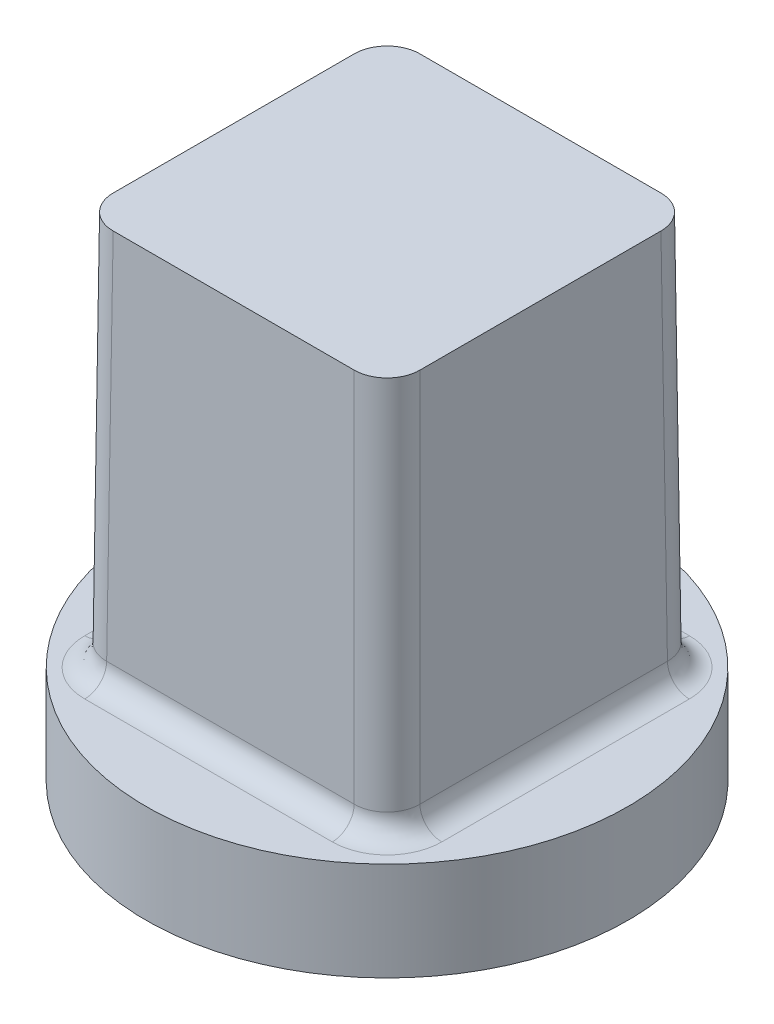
ISO-10303-21;
HEADER;
FILE_DESCRIPTION(('STEP AP214'),'2;1');
FILE_NAME('part.step','',(''),(''),'','','');
FILE_SCHEMA(('AUTOMOTIVE_DESIGN { 1 0 10303 214 1 1 1 1 }'));
ENDSEC;
DATA;
#1=APPLICATION_CONTEXT('core data for automotive mechanical design processes');
#2=APPLICATION_PROTOCOL_DEFINITION('international standard','automotive_design',2000,#1);
#3=PRODUCT_CONTEXT('',#1,'mechanical');
#4=PRODUCT('Part','Part','',(#3));
#5=PRODUCT_RELATED_PRODUCT_CATEGORY('part','',(#4));
#6=PRODUCT_DEFINITION_FORMATION('','',#4);
#7=PRODUCT_DEFINITION_CONTEXT('part definition',#1,'design');
#8=PRODUCT_DEFINITION('design','',#6,#7);
#9=PRODUCT_DEFINITION_SHAPE('','',#8);
#10=(LENGTH_UNIT() NAMED_UNIT(*) SI_UNIT(.MILLI.,.METRE.));
#11=(NAMED_UNIT(*) PLANE_ANGLE_UNIT() SI_UNIT($,.RADIAN.));
#12=(NAMED_UNIT(*) SI_UNIT($,.STERADIAN.) SOLID_ANGLE_UNIT());
#13=UNCERTAINTY_MEASURE_WITH_UNIT(LENGTH_MEASURE(1.E-05),#10,'distance_accuracy_value','');
#14=(GEOMETRIC_REPRESENTATION_CONTEXT(3) GLOBAL_UNCERTAINTY_ASSIGNED_CONTEXT((#13)) GLOBAL_UNIT_ASSIGNED_CONTEXT((#10,
#11,#12)) REPRESENTATION_CONTEXT('',''));
#15=CARTESIAN_POINT('',(0.,0.,0.));
#16=DIRECTION('',(0.,0.,1.));
#17=DIRECTION('',(1.,0.,0.));
#18=AXIS2_PLACEMENT_3D('',#15,#16,#17);
#19=CARTESIAN_POINT('',(0.,19.5,0.));
#20=DIRECTION('',(0.,-1.,0.));
#21=DIRECTION('',(0.,0.,-1.));
#22=AXIS2_PLACEMENT_3D('',#19,#20,#21);
#23=PLANE('',#22);
#24=DIRECTION('',(1.,0.,0.));
#25=VECTOR('',#24,1.);
#26=CARTESIAN_POINT('',(0.,19.5,-7.));
#27=LINE('',#26,#25);
#28=CARTESIAN_POINT('',(-5.50005711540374,19.5,-7.));
#29=VERTEX_POINT('',#28);
#30=CARTESIAN_POINT('',(5.50005711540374,19.5,-7.));
#31=VERTEX_POINT('',#30);
#32=EDGE_CURVE('E144',#29,#31,#27,.T.);
#33=ORIENTED_EDGE('',*,*,#32,.F.);
#34=CARTESIAN_POINT('',(-5.49994288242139,19.5,-5.49994288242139));
#35=DIRECTION('',(0.,-1.,0.));
#36=DIRECTION('',(0.707106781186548,0.,0.707106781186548));
#37=AXIS2_PLACEMENT_3D('',#34,#35,#36);
#38=ELLIPSE('',#37,1.50011423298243,1.5);
#39=CARTESIAN_POINT('',(-7.,19.5,-5.50005711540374));
#40=VERTEX_POINT('',#39);
#41=EDGE_CURVE('E149',#29,#40,#38,.F.);
#42=ORIENTED_EDGE('',*,*,#41,.T.);
#43=DIRECTION('',(0.,0.,-1.));
#44=VECTOR('',#43,1.);
#45=CARTESIAN_POINT('',(-7.,19.5,0.));
#46=LINE('',#45,#44);
#47=CARTESIAN_POINT('',(-7.,19.5,5.50005711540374));
#48=VERTEX_POINT('',#47);
#49=EDGE_CURVE('E161',#48,#40,#46,.T.);
#50=ORIENTED_EDGE('',*,*,#49,.F.);
#51=CARTESIAN_POINT('',(-5.49994288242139,19.5,5.4999428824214));
#52=DIRECTION('',(0.,-1.,0.));
#53=DIRECTION('',(0.707106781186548,0.,-0.707106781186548));
#54=AXIS2_PLACEMENT_3D('',#51,#52,#53);
#55=ELLIPSE('',#54,1.50011423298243,1.5);
#56=CARTESIAN_POINT('',(-5.50005711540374,19.5,7.));
#57=VERTEX_POINT('',#56);
#58=EDGE_CURVE('E156',#48,#57,#55,.F.);
#59=ORIENTED_EDGE('',*,*,#58,.T.);
#60=DIRECTION('',(1.,0.,0.));
#61=VECTOR('',#60,1.);
#62=CARTESIAN_POINT('',(0.,19.5,7.));
#63=LINE('',#62,#61);
#64=CARTESIAN_POINT('',(5.50005711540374,19.5,7.));
#65=VERTEX_POINT('',#64);
#66=EDGE_CURVE('E168',#65,#57,#63,.F.);
#67=ORIENTED_EDGE('',*,*,#66,.F.);
#68=CARTESIAN_POINT('',(5.49994288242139,19.5,5.49994288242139));
#69=DIRECTION('',(0.,-1.,0.));
#70=DIRECTION('',(-0.707106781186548,0.,-0.707106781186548));
#71=AXIS2_PLACEMENT_3D('',#68,#69,#70);
#72=ELLIPSE('',#71,1.50011423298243,1.5);
#73=CARTESIAN_POINT('',(7.,19.5,5.50005711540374));
#74=VERTEX_POINT('',#73);
#75=EDGE_CURVE('E184',#65,#74,#72,.F.);
#76=ORIENTED_EDGE('',*,*,#75,.T.);
#77=DIRECTION('',(0.,0.,-1.));
#78=VECTOR('',#77,1.);
#79=CARTESIAN_POINT('',(7.,19.5,0.));
#80=LINE('',#79,#78);
#81=CARTESIAN_POINT('',(7.,19.5,-5.50005711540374));
#82=VERTEX_POINT('',#81);
#83=EDGE_CURVE('E178',#82,#74,#80,.F.);
#84=ORIENTED_EDGE('',*,*,#83,.F.);
#85=CARTESIAN_POINT('',(5.49994288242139,19.5,-5.49994288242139));
#86=DIRECTION('',(0.,-1.,0.));
#87=DIRECTION('',(-0.707106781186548,0.,0.707106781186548));
#88=AXIS2_PLACEMENT_3D('',#85,#86,#87);
#89=ELLIPSE('',#88,1.50011423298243,1.5);
#90=EDGE_CURVE('E146',#82,#31,#89,.F.);
#91=ORIENTED_EDGE('',*,*,#90,.T.);
#92=EDGE_LOOP('',(#33,#42,#50,#59,#67,#76,#84,#91));
#93=FACE_BOUND('',#92,.T.);
#94=ADVANCED_FACE('F50',(#93),#23,.F.);
#95=CARTESIAN_POINT('',(7.,19.5,-7.));
#96=DIRECTION('',(0.999961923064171,0.00872653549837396,0.));
#97=DIRECTION('',(-0.00872653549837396,0.999961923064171,0.));
#98=AXIS2_PLACEMENT_3D('',#95,#96,#97);
#99=PLANE('',#98);
#100=DIRECTION('',(-0.00872620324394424,0.999923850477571,-0.00872620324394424));
#101=VECTOR('',#100,1.);
#102=CARTESIAN_POINT('',(6.99904816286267,19.6090697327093,5.49910527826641));
#103=LINE('',#102,#101);
#104=CARTESIAN_POINT('',(7.14843290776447,2.4912734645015,5.64849002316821));
#105=VERTEX_POINT('',#104);
#106=EDGE_CURVE('E196',#74,#105,#103,.F.);
#107=ORIENTED_EDGE('',*,*,#106,.T.);
#108=DIRECTION('',(0.,0.,-1.));
#109=VECTOR('',#108,1.);
#110=CARTESIAN_POINT('',(7.14843290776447,2.49127346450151,-7.));
#111=LINE('',#110,#109);
#112=CARTESIAN_POINT('',(7.14843290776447,2.4912734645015,-5.64849002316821));
#113=VERTEX_POINT('',#112);
#114=EDGE_CURVE('E221',#105,#113,#111,.T.);
#115=ORIENTED_EDGE('',*,*,#114,.T.);
#116=DIRECTION('',(-0.00872620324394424,0.999923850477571,0.00872620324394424));
#117=VECTOR('',#116,1.);
#118=CARTESIAN_POINT('',(7.00011421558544,19.4869121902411,-5.50017133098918));
#119=LINE('',#118,#117);
#120=EDGE_CURVE('E194',#113,#82,#119,.T.);
#121=ORIENTED_EDGE('',*,*,#120,.T.);
#122=ORIENTED_EDGE('',*,*,#83,.T.);
#123=EDGE_LOOP('',(#107,#115,#121,#122));
#124=FACE_BOUND('',#123,.T.);
#125=ADVANCED_FACE('F306',(#124),#99,.T.);
#126=CARTESIAN_POINT('',(7.,19.5,7.));
#127=DIRECTION('',(0.,0.00872653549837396,0.999961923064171));
#128=DIRECTION('',(0.,-0.999961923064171,0.00872653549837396));
#129=AXIS2_PLACEMENT_3D('',#126,#127,#128);
#130=PLANE('',#129);
#131=DIRECTION('',(0.00872620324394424,0.999923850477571,-0.00872620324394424));
#132=VECTOR('',#131,1.);
#133=CARTESIAN_POINT('',(-5.49910527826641,19.6090697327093,6.99904816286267));
#134=LINE('',#133,#132);
#135=CARTESIAN_POINT('',(-5.64849002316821,2.4912734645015,7.14843290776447));
#136=VERTEX_POINT('',#135);
#137=EDGE_CURVE('E191',#57,#136,#134,.F.);
#138=ORIENTED_EDGE('',*,*,#137,.T.);
#139=DIRECTION('',(1.,0.,0.));
#140=VECTOR('',#139,1.);
#141=CARTESIAN_POINT('',(7.,2.49127346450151,7.14843290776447));
#142=LINE('',#141,#140);
#143=CARTESIAN_POINT('',(5.64849002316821,2.4912734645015,7.14843290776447));
#144=VERTEX_POINT('',#143);
#145=EDGE_CURVE('E219',#136,#144,#142,.T.);
#146=ORIENTED_EDGE('',*,*,#145,.T.);
#147=DIRECTION('',(-0.00872620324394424,0.999923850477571,-0.00872620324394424));
#148=VECTOR('',#147,1.);
#149=CARTESIAN_POINT('',(5.50017133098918,19.4869121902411,7.00011421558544));
#150=LINE('',#149,#148);
#151=EDGE_CURVE('E189',#144,#65,#150,.T.);
#152=ORIENTED_EDGE('',*,*,#151,.T.);
#153=ORIENTED_EDGE('',*,*,#66,.T.);
#154=EDGE_LOOP('',(#138,#146,#152,#153));
#155=FACE_BOUND('',#154,.T.);
#156=ADVANCED_FACE('F310',(#155),#130,.T.);
#157=CARTESIAN_POINT('',(-7.,19.5,-7.));
#158=DIRECTION('',(-0.999961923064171,0.00872653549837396,0.));
#159=DIRECTION('',(-0.00872653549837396,-0.999961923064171,0.));
#160=AXIS2_PLACEMENT_3D('',#157,#158,#159);
#161=PLANE('',#160);
#162=DIRECTION('',(0.00872620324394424,0.999923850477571,0.00872620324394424));
#163=VECTOR('',#162,1.);
#164=CARTESIAN_POINT('',(-7.00011421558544,19.4869121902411,-5.50017133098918));
#165=LINE('',#164,#163);
#166=CARTESIAN_POINT('',(-7.14843290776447,2.4912734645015,-5.64849002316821));
#167=VERTEX_POINT('',#166);
#168=EDGE_CURVE('E151',#40,#167,#165,.F.);
#169=ORIENTED_EDGE('',*,*,#168,.T.);
#170=DIRECTION('',(0.,0.,1.));
#171=VECTOR('',#170,1.);
#172=CARTESIAN_POINT('',(-7.14843290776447,2.49127346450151,-7.));
#173=LINE('',#172,#171);
#174=CARTESIAN_POINT('',(-7.14843290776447,2.4912734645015,5.64849002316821));
#175=VERTEX_POINT('',#174);
#176=EDGE_CURVE('E227',#167,#175,#173,.T.);
#177=ORIENTED_EDGE('',*,*,#176,.T.);
#178=DIRECTION('',(0.00872620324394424,0.999923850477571,-0.00872620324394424));
#179=VECTOR('',#178,1.);
#180=CARTESIAN_POINT('',(-6.99904816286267,19.6090697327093,5.49910527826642));
#181=LINE('',#180,#179);
#182=EDGE_CURVE('E155',#175,#48,#181,.T.);
#183=ORIENTED_EDGE('',*,*,#182,.T.);
#184=ORIENTED_EDGE('',*,*,#49,.T.);
#185=EDGE_LOOP('',(#169,#177,#183,#184));
#186=FACE_BOUND('',#185,.T.);
#187=ADVANCED_FACE('F302',(#186),#161,.T.);
#188=CARTESIAN_POINT('',(7.,19.5,-7.));
#189=DIRECTION('',(0.,0.00872653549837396,-0.999961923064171));
#190=DIRECTION('',(0.,0.999961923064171,0.00872653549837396));
#191=AXIS2_PLACEMENT_3D('',#188,#189,#190);
#192=PLANE('',#191);
#193=DIRECTION('',(-0.00872620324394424,0.999923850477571,0.00872620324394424));
#194=VECTOR('',#193,1.);
#195=CARTESIAN_POINT('',(5.50017133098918,19.4869121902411,-7.00011421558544));
#196=LINE('',#195,#194);
#197=CARTESIAN_POINT('',(5.64849002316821,2.4912734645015,-7.14843290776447));
#198=VERTEX_POINT('',#197);
#199=EDGE_CURVE('E147',#31,#198,#196,.F.);
#200=ORIENTED_EDGE('',*,*,#199,.T.);
#201=DIRECTION('',(-1.,0.,0.));
#202=VECTOR('',#201,1.);
#203=CARTESIAN_POINT('',(7.,2.49127346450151,-7.14843290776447));
#204=LINE('',#203,#202);
#205=CARTESIAN_POINT('',(-5.64849002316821,2.4912734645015,-7.14843290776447));
#206=VERTEX_POINT('',#205);
#207=EDGE_CURVE('E61',#198,#206,#204,.T.);
#208=ORIENTED_EDGE('',*,*,#207,.T.);
#209=DIRECTION('',(0.00872620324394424,0.999923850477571,0.00872620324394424));
#210=VECTOR('',#209,1.);
#211=CARTESIAN_POINT('',(-5.49910527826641,19.6090697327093,-6.99904816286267));
#212=LINE('',#211,#210);
#213=EDGE_CURVE('E140',#206,#29,#212,.T.);
#214=ORIENTED_EDGE('',*,*,#213,.T.);
#215=ORIENTED_EDGE('',*,*,#32,.T.);
#216=EDGE_LOOP('',(#200,#208,#214,#215));
#217=FACE_BOUND('',#216,.T.);
#218=ADVANCED_FACE('F142',(#217),#192,.T.);
#219=CARTESIAN_POINT('',(0.,-3.,0.));
#220=DIRECTION('',(0.,1.,0.));
#221=DIRECTION('',(0.,0.,1.));
#222=AXIS2_PLACEMENT_3D('',#219,#220,#221);
#223=CYLINDRICAL_SURFACE('',#222,11.);
#224=CARTESIAN_POINT('',(0.,-3.,0.));
#225=DIRECTION('',(0.,1.,0.));
#226=DIRECTION('',(0.,0.,-1.));
#227=AXIS2_PLACEMENT_3D('',#224,#225,#226);
#228=CIRCLE('',#227,11.);
#229=CARTESIAN_POINT('',(0.,-3.,-11.));
#230=VERTEX_POINT('',#229);
#231=EDGE_CURVE('E162',#230,#230,#228,.T.);
#232=ORIENTED_EDGE('',*,*,#231,.T.);
#233=EDGE_LOOP('',(#232));
#234=FACE_BOUND('',#233,.T.);
#235=CARTESIAN_POINT('',(0.,1.5,0.));
#236=DIRECTION('',(0.,1.,0.));
#237=DIRECTION('',(0.,0.,-1.));
#238=AXIS2_PLACEMENT_3D('',#235,#236,#237);
#239=CIRCLE('',#238,11.);
#240=CARTESIAN_POINT('',(0.,1.5,-11.));
#241=VERTEX_POINT('',#240);
#242=EDGE_CURVE('E171',#241,#241,#239,.T.);
#243=ORIENTED_EDGE('',*,*,#242,.F.);
#244=EDGE_LOOP('',(#243));
#245=FACE_BOUND('',#244,.T.);
#246=ADVANCED_FACE('F293',(#234,#245),#223,.T.);
#247=CARTESIAN_POINT('',(0.,-3.,0.));
#248=DIRECTION('',(0.,-1.,0.));
#249=DIRECTION('',(0.,0.,-1.));
#250=AXIS2_PLACEMENT_3D('',#247,#248,#249);
#251=PLANE('',#250);
#252=ORIENTED_EDGE('',*,*,#231,.F.);
#253=EDGE_LOOP('',(#252));
#254=FACE_BOUND('',#253,.T.);
#255=ADVANCED_FACE('F295',(#254),#251,.T.);
#256=CARTESIAN_POINT('',(0.,1.5,0.));
#257=DIRECTION('',(0.,-1.,0.));
#258=DIRECTION('',(0.,0.,-1.));
#259=AXIS2_PLACEMENT_3D('',#256,#257,#258);
#260=PLANE('',#259);
#261=DIRECTION('',(0.,0.,-1.));
#262=VECTOR('',#261,1.);
#263=CARTESIAN_POINT('',(8.14839483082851,1.5,0.));
#264=LINE('',#263,#262);
#265=CARTESIAN_POINT('',(8.14839483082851,1.5,-5.64849002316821));
#266=VERTEX_POINT('',#265);
#267=CARTESIAN_POINT('',(8.14839483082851,1.5,5.64849002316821));
#268=VERTEX_POINT('',#267);
#269=EDGE_CURVE('E209',#266,#268,#264,.F.);
#270=ORIENTED_EDGE('',*,*,#269,.T.);
#271=CARTESIAN_POINT('',(5.64829963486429,1.5,5.6482996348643));
#272=DIRECTION('',(0.,-1.,0.));
#273=DIRECTION('',(-0.707106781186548,0.,-0.707106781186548));
#274=AXIS2_PLACEMENT_3D('',#271,#272,#273);
#275=ELLIPSE('',#274,2.50019038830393,2.49999999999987);
#276=CARTESIAN_POINT('',(5.64849002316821,1.5,8.14839483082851));
#277=VERTEX_POINT('',#276);
#278=EDGE_CURVE('E213',#268,#277,#275,.T.);
#279=ORIENTED_EDGE('',*,*,#278,.T.);
#280=DIRECTION('',(1.,0.,0.));
#281=VECTOR('',#280,1.);
#282=CARTESIAN_POINT('',(0.,1.5,8.14839483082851));
#283=LINE('',#282,#281);
#284=CARTESIAN_POINT('',(-5.64849002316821,1.5,8.14839483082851));
#285=VERTEX_POINT('',#284);
#286=EDGE_CURVE('E211',#277,#285,#283,.F.);
#287=ORIENTED_EDGE('',*,*,#286,.T.);
#288=CARTESIAN_POINT('',(-5.64829963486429,1.5,5.6482996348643));
#289=DIRECTION('',(0.,-1.,0.));
#290=DIRECTION('',(0.707106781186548,0.,-0.707106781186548));
#291=AXIS2_PLACEMENT_3D('',#288,#289,#290);
#292=ELLIPSE('',#291,2.50019038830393,2.49999999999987);
#293=CARTESIAN_POINT('',(-8.14839483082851,1.5,5.64849002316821));
#294=VERTEX_POINT('',#293);
#295=EDGE_CURVE('E207',#285,#294,#292,.T.);
#296=ORIENTED_EDGE('',*,*,#295,.T.);
#297=DIRECTION('',(0.,0.,1.));
#298=VECTOR('',#297,1.);
#299=CARTESIAN_POINT('',(-8.14839483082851,1.5,0.));
#300=LINE('',#299,#298);
#301=CARTESIAN_POINT('',(-8.14839483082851,1.5,-5.64849002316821));
#302=VERTEX_POINT('',#301);
#303=EDGE_CURVE('E203',#294,#302,#300,.F.);
#304=ORIENTED_EDGE('',*,*,#303,.T.);
#305=CARTESIAN_POINT('',(-5.6482996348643,1.5,-5.64829963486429));
#306=DIRECTION('',(0.,-1.,0.));
#307=DIRECTION('',(0.707106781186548,0.,0.707106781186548));
#308=AXIS2_PLACEMENT_3D('',#305,#306,#307);
#309=ELLIPSE('',#308,2.50019038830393,2.49999999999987);
#310=CARTESIAN_POINT('',(-5.64849002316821,1.5,-8.14839483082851));
#311=VERTEX_POINT('',#310);
#312=EDGE_CURVE('E199',#302,#311,#309,.T.);
#313=ORIENTED_EDGE('',*,*,#312,.T.);
#314=DIRECTION('',(-1.,0.,0.));
#315=VECTOR('',#314,1.);
#316=CARTESIAN_POINT('',(0.,1.5,-8.14839483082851));
#317=LINE('',#316,#315);
#318=CARTESIAN_POINT('',(5.64849002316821,1.5,-8.14839483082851));
#319=VERTEX_POINT('',#318);
#320=EDGE_CURVE('E201',#311,#319,#317,.F.);
#321=ORIENTED_EDGE('',*,*,#320,.T.);
#322=CARTESIAN_POINT('',(5.64829963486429,1.5,-5.64829963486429));
#323=DIRECTION('',(0.,-1.,0.));
#324=DIRECTION('',(-0.707106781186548,0.,0.707106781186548));
#325=AXIS2_PLACEMENT_3D('',#322,#323,#324);
#326=ELLIPSE('',#325,2.50019038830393,2.49999999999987);
#327=EDGE_CURVE('E205',#319,#266,#326,.T.);
#328=ORIENTED_EDGE('',*,*,#327,.T.);
#329=EDGE_LOOP('',(#270,#279,#287,#296,#304,#313,#321,#328));
#330=FACE_BOUND('',#329,.T.);
#331=ORIENTED_EDGE('',*,*,#242,.T.);
#332=EDGE_LOOP('',(#331));
#333=FACE_BOUND('',#332,.T.);
#334=ADVANCED_FACE('F249',(#330,#333),#260,.F.);
#335=CARTESIAN_POINT('',(-5.49910527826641,19.5959799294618,-5.49910527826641));
#336=DIRECTION('',(0.00872620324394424,0.99992385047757,0.00872620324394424));
#337=DIRECTION('',(0.,-0.00872653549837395,0.999961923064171));
#338=AXIS2_PLACEMENT_3D('',#335,#336,#337);
#339=CYLINDRICAL_SURFACE('',#338,1.5);
#340=ORIENTED_EDGE('',*,*,#213,.F.);
#341=CARTESIAN_POINT('',(-5.6482996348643,2.49999999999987,-5.64829963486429));
#342=DIRECTION('',(-0.00581623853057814,0.999966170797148,-0.00581623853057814));
#343=DIRECTION('',(0.707082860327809,0.00822540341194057,0.707082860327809));
#344=AXIS2_PLACEMENT_3D('',#341,#342,#343);
#345=ELLIPSE('',#344,1.50031729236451,1.5);
#346=EDGE_CURVE('E13',#206,#167,#345,.T.);
#347=ORIENTED_EDGE('',*,*,#346,.T.);
#348=ORIENTED_EDGE('',*,*,#168,.F.);
#349=ORIENTED_EDGE('',*,*,#41,.F.);
#350=EDGE_LOOP('',(#340,#347,#348,#349));
#351=FACE_BOUND('',#350,.T.);
#352=ADVANCED_FACE('F150',(#351),#339,.T.);
#353=CARTESIAN_POINT('',(-5.49910527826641,19.5959799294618,5.49910527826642));
#354=DIRECTION('',(0.00872620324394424,0.99992385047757,-0.00872620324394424));
#355=DIRECTION('',(0.,0.00872653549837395,0.999961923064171));
#356=AXIS2_PLACEMENT_3D('',#353,#354,#355);
#357=CYLINDRICAL_SURFACE('',#356,1.5);
#358=ORIENTED_EDGE('',*,*,#182,.F.);
#359=CARTESIAN_POINT('',(-5.64829963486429,2.49999999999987,5.6482996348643));
#360=DIRECTION('',(-0.00581623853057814,0.999966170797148,0.00581623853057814));
#361=DIRECTION('',(0.707082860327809,0.00822540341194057,-0.707082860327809));
#362=AXIS2_PLACEMENT_3D('',#359,#360,#361);
#363=ELLIPSE('',#362,1.50031729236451,1.5);
#364=EDGE_CURVE('E223',#175,#136,#363,.T.);
#365=ORIENTED_EDGE('',*,*,#364,.T.);
#366=ORIENTED_EDGE('',*,*,#137,.F.);
#367=ORIENTED_EDGE('',*,*,#58,.F.);
#368=EDGE_LOOP('',(#358,#365,#366,#367));
#369=FACE_BOUND('',#368,.T.);
#370=ADVANCED_FACE('F257',(#369),#357,.T.);
#371=CARTESIAN_POINT('',(5.50017133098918,19.4738223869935,5.50017133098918));
#372=DIRECTION('',(-0.00872620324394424,0.99992385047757,-0.00872620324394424));
#373=DIRECTION('',(0.,0.00872653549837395,0.999961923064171));
#374=AXIS2_PLACEMENT_3D('',#371,#372,#373);
#375=CYLINDRICAL_SURFACE('',#374,1.5);
#376=ORIENTED_EDGE('',*,*,#151,.F.);
#377=CARTESIAN_POINT('',(5.64829963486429,2.49999999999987,5.6482996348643));
#378=DIRECTION('',(0.00581623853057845,0.999966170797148,0.00581623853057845));
#379=DIRECTION('',(-0.707082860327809,0.008225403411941,-0.707082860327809));
#380=AXIS2_PLACEMENT_3D('',#377,#378,#379);
#381=ELLIPSE('',#380,1.50031729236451,1.5);
#382=EDGE_CURVE('E216',#144,#105,#381,.T.);
#383=ORIENTED_EDGE('',*,*,#382,.T.);
#384=ORIENTED_EDGE('',*,*,#106,.F.);
#385=ORIENTED_EDGE('',*,*,#75,.F.);
#386=EDGE_LOOP('',(#376,#383,#384,#385));
#387=FACE_BOUND('',#386,.T.);
#388=ADVANCED_FACE('F253',(#387),#375,.T.);
#389=CARTESIAN_POINT('',(5.50017133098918,19.4738223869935,-5.50017133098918));
#390=DIRECTION('',(-0.00872620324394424,0.99992385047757,0.00872620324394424));
#391=DIRECTION('',(0.,-0.00872653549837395,0.999961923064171));
#392=AXIS2_PLACEMENT_3D('',#389,#390,#391);
#393=CYLINDRICAL_SURFACE('',#392,1.5);
#394=ORIENTED_EDGE('',*,*,#120,.F.);
#395=CARTESIAN_POINT('',(5.64829963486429,2.49999999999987,-5.64829963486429));
#396=DIRECTION('',(0.00581623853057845,0.999966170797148,-0.00581623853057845));
#397=DIRECTION('',(-0.707082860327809,0.008225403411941,0.707082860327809));
#398=AXIS2_PLACEMENT_3D('',#395,#396,#397);
#399=ELLIPSE('',#398,1.50031729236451,1.5);
#400=EDGE_CURVE('E225',#113,#198,#399,.T.);
#401=ORIENTED_EDGE('',*,*,#400,.T.);
#402=ORIENTED_EDGE('',*,*,#199,.F.);
#403=ORIENTED_EDGE('',*,*,#90,.F.);
#404=EDGE_LOOP('',(#394,#401,#402,#403));
#405=FACE_BOUND('',#404,.T.);
#406=ADVANCED_FACE('F246',(#405),#393,.T.);
#407=CARTESIAN_POINT('',(-3.88039805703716,1.5,-3.88039805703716));
#408=CARTESIAN_POINT('',(-4.59628555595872,1.5,-4.59628555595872));
#409=CARTESIAN_POINT('',(-4.58745099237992,2.51234071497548,-4.58745099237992));
#410=CARTESIAN_POINT('',(-3.95753134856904,1.5,-3.80326476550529));
#411=CARTESIAN_POINT('',(-4.64218003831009,1.5,-4.55039107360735));
#412=CARTESIAN_POINT('',(-4.63373096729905,2.51234071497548,-4.5411710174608));
#413=CARTESIAN_POINT('',(-4.03972061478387,1.5,-3.73118744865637));
#414=CARTESIAN_POINT('',(-4.69105549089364,1.5,-4.50748084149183));
#415=CARTESIAN_POINT('',(-4.68304483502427,2.51230542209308,-4.49792493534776));
#416=CARTESIAN_POINT('',(-4.21280478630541,1.5,-3.59837800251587));
#417=CARTESIAN_POINT('',(-4.79396200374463,1.5,-4.42834012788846));
#418=CARTESIAN_POINT('',(-4.78689656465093,2.51216485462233,-4.4182404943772));
#419=CARTESIAN_POINT('',(-4.30369971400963,1.5,-3.53764590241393));
#420=CARTESIAN_POINT('',(-4.8479890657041,1.5,-4.39211199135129));
#421=CARTESIAN_POINT('',(-4.84143443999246,2.51205957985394,-4.38180215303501));
#422=CARTESIAN_POINT('',(-4.49263995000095,1.5,-3.42856600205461));
#423=CARTESIAN_POINT('',(-4.96030123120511,1.5,-4.32694564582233));
#424=CARTESIAN_POINT('',(-4.9548010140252,2.51178085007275,-4.31635664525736));
#425=CARTESIAN_POINT('',(-4.5906852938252,1.5,-3.38021826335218));
#426=CARTESIAN_POINT('',(-5.0185818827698,1.5,-4.29800869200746));
#427=CARTESIAN_POINT('',(-5.01362973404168,2.51160739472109,-4.28734951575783));
#428=CARTESIAN_POINT('',(-4.79224876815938,1.5,-3.29673429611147));
#429=CARTESIAN_POINT('',(-5.13843246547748,1.5,-4.24791750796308));
#430=CARTESIAN_POINT('',(-5.13457141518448,2.51119527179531,-4.23726273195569));
#431=CARTESIAN_POINT('',(-4.89576693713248,1.5,-3.26159816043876));
#432=CARTESIAN_POINT('',(-5.19999778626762,1.5,-4.22676336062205));
#433=CARTESIAN_POINT('',(-5.19668439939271,2.51095660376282,-4.21618313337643));
#434=CARTESIAN_POINT('',(-5.10650483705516,1.5,-3.205138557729));
#435=CARTESIAN_POINT('',(-5.3253923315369,1.5,-4.19260494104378));
#436=CARTESIAN_POINT('',(-5.32313183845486,2.51041813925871,-4.1823120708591));
#437=CARTESIAN_POINT('',(-5.21372459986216,1.5,-3.18381520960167));
#438=CARTESIAN_POINT('',(-5.38921709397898,1.5,-4.17959957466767));
#439=CARTESIAN_POINT('',(-5.38746631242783,2.51011834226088,-4.16952067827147));
#440=CARTESIAN_POINT('',(-5.43003113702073,1.5,-3.15534600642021));
#441=CARTESIAN_POINT('',(-5.51806411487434,1.5,-4.16197357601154));
#442=CARTESIAN_POINT('',(-5.51725595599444,2.50946274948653,-4.15244487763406));
#443=CARTESIAN_POINT('',(-5.53911792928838,1.5,-3.14820028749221));
#444=CARTESIAN_POINT('',(-5.58308235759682,1.5,-4.15735074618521));
#445=CARTESIAN_POINT('',(-5.58271113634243,2.50910695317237,-4.14816055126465));
#446=CARTESIAN_POINT('',(-5.75729203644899,1.5,-3.14820859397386));
#447=CARTESIAN_POINT('',(-5.71322535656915,1.5,-4.1565874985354));
#448=CARTESIAN_POINT('',(-5.71362224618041,2.50834544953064,-4.14817218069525));
#449=CARTESIAN_POINT('',(-5.86637935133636,1.5,-3.15536276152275));
#450=CARTESIAN_POINT('',(-5.77834681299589,1.5,-4.16044392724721));
#451=CARTESIAN_POINT('',(-5.77907817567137,2.50793974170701,-4.15246822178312));
#452=CARTESIAN_POINT('',(-6.08268800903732,1.5,-3.1838484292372));
#453=CARTESIAN_POINT('',(-5.90759785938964,1.5,-4.176596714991));
#454=CARTESIAN_POINT('',(-5.90887082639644,2.50708535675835,-4.16956707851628));
#455=CARTESIAN_POINT('',(-6.18990933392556,1.5,-3.20518006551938));
#456=CARTESIAN_POINT('',(-5.97172508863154,1.5,-4.18888917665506));
#457=CARTESIAN_POINT('',(-5.97320753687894,2.50663667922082,-4.18236997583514));
#458=CARTESIAN_POINT('',(-6.4006514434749,1.5,-3.26165569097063));
#459=CARTESIAN_POINT('',(-6.09789961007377,1.5,-4.22173046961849));
#460=CARTESIAN_POINT('',(-6.09966094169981,2.50570403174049,-4.21626349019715));
#461=CARTESIAN_POINT('',(-6.50417219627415,1.5,-3.29679979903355));
#462=CARTESIAN_POINT('',(-6.15994564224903,1.5,-4.24227492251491));
#463=CARTESIAN_POINT('',(-6.16177761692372,2.50522006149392,-4.23735417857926));
#464=CARTESIAN_POINT('',(-6.70574190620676,1.5,-3.38029906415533));
#465=CARTESIAN_POINT('',(-6.28089801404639,1.5,-4.2912968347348));
#466=CARTESIAN_POINT('',(-6.2827281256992,2.50422510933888,-4.28746242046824));
#467=CARTESIAN_POINT('',(-6.80379082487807,1.5,-3.42865431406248));
#468=CARTESIAN_POINT('',(-6.3398042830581,1.5,-4.31976973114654));
#469=CARTESIAN_POINT('',(-6.34156193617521,2.50371412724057,-4.31648002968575));
#470=CARTESIAN_POINT('',(-6.99273922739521,1.5,-3.53774852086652));
#471=CARTESIAN_POINT('',(-6.45346372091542,1.5,-4.3841889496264));
#472=CARTESIAN_POINT('',(-6.45494005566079,2.50267389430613,-4.38194563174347));
#473=CARTESIAN_POINT('',(-7.08363867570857,1.5,-3.59848753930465));
#474=CARTESIAN_POINT('',(-6.50821801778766,1.5,-4.42013083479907));
#475=CARTESIAN_POINT('',(-6.50948434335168,2.50214464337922,-4.41839366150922));
#476=CARTESIAN_POINT('',(-7.25673281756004,1.5,-3.73131005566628));
#477=CARTESIAN_POINT('',(-6.61262420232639,1.5,-4.49889820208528));
#478=CARTESIAN_POINT('',(-6.61335014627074,2.50107692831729,-4.49809648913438));
#479=CARTESIAN_POINT('',(-7.33892748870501,1.5,-3.80339358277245));
#480=CARTESIAN_POINT('',(-6.6622783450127,1.5,-4.54171967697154));
#481=CARTESIAN_POINT('',(-6.66267164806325,2.50053846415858,-4.54135130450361));
#482=CARTESIAN_POINT('',(-7.49320568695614,1.5,-3.95767178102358));
#483=CARTESIAN_POINT('',(-6.7556161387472,1.5,-4.63353452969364));
#484=CARTESIAN_POINT('',(-6.75524796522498,2.49946153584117,-4.63392762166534));
#485=CARTESIAN_POINT('',(-7.56528921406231,1.5,-4.03986645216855));
#486=CARTESIAN_POINT('',(-6.79930302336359,1.5,-4.68252460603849));
#487=CARTESIAN_POINT('',(-6.79850278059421,2.49892307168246,-4.68324912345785));
#488=CARTESIAN_POINT('',(-7.69811173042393,1.5,-4.21296059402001));
#489=CARTESIAN_POINT('',(-6.87993558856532,1.5,-4.78585386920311));
#490=CARTESIAN_POINT('',(-6.87820560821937,2.49785535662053,-4.78711492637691));
#491=CARTESIAN_POINT('',(-7.75885074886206,1.5,-4.30386004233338));
#492=CARTESIAN_POINT('',(-6.91688526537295,1.5,-4.84019068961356));
#493=CARTESIAN_POINT('',(-6.91465363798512,2.49732610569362,-4.8416592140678));
#494=CARTESIAN_POINT('',(-7.8679449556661,1.5,-4.49280844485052));
#495=CARTESIAN_POINT('',(-6.98338486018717,1.5,-4.95329260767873));
#496=CARTESIAN_POINT('',(-6.98011924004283,2.49628587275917,-4.95503733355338));
#497=CARTESIAN_POINT('',(-7.91630020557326,1.5,-4.59085736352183));
#498=CARTESIAN_POINT('',(-7.0129392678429,1.5,-5.01205644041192));
#499=CARTESIAN_POINT('',(-7.00913684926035,2.49577489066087,-5.01387114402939));
#500=CARTESIAN_POINT('',(-7.99979947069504,1.5,-4.79242707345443));
#501=CARTESIAN_POINT('',(-7.0641149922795,1.5,-5.13300869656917));
#502=CARTESIAN_POINT('',(-7.05924509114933,2.49477993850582,-5.13482165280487));
#503=CARTESIAN_POINT('',(-8.03494357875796,1.5,-4.89594782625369));
#504=CARTESIAN_POINT('',(-7.0857409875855,1.5,-5.19519704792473));
#505=CARTESIAN_POINT('',(-7.08033577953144,2.49429596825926,-5.19693832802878));
#506=CARTESIAN_POINT('',(-8.0914192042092,1.5,-5.10668993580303));
#507=CARTESIAN_POINT('',(-7.12066277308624,1.5,-5.32192888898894));
#508=CARTESIAN_POINT('',(-7.11422929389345,2.49336332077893,-5.32339173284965));
#509=CARTESIAN_POINT('',(-8.11275084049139,1.5,-5.21391126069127));
#510=CARTESIAN_POINT('',(-7.13396311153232,1.5,-5.38647350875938));
#511=CARTESIAN_POINT('',(-7.12703219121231,2.4929146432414,-5.38772844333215));
#512=CARTESIAN_POINT('',(-8.14123650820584,1.5,-5.43021991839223));
#513=CARTESIAN_POINT('',(-7.15198129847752,1.5,-5.51680136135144));
#514=CARTESIAN_POINT('',(-7.14413104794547,2.49206025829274,-5.51752109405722));
#515=CARTESIAN_POINT('',(-8.14839067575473,1.5,-5.5393072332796));
#516=CARTESIAN_POINT('',(-7.1567032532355,1.5,-5.58258685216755));
#517=CARTESIAN_POINT('',(-7.14842708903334,2.49165455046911,-5.58297702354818));
#518=CARTESIAN_POINT('',(-8.14839898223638,1.5,-5.7574813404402));
#519=CARTESIAN_POINT('',(-7.15746317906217,1.5,-5.7142527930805));
#520=CARTESIAN_POINT('',(-7.14843871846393,2.49089304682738,-5.71388813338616));
#521=CARTESIAN_POINT('',(-8.14125326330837,1.5,-5.86656813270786));
#522=CARTESIAN_POINT('',(-7.15350453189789,1.5,-5.7801364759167));
#523=CARTESIAN_POINT('',(-7.14415439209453,2.49053725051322,-5.77934331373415));
#524=CARTESIAN_POINT('',(-8.11278406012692,1.5,-6.08287466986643));
#525=CARTESIAN_POINT('',(-7.13695565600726,1.5,-5.91084881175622));
#526=CARTESIAN_POINT('',(-7.12707859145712,2.48988165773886,-5.90913295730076));
#527=CARTESIAN_POINT('',(-8.09146071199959,1.5,-6.19009443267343));
#528=CARTESIAN_POINT('',(-7.1243678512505,1.5,-5.97568145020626));
#529=CARTESIAN_POINT('',(-7.11428719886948,2.48958186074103,-5.97346743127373));
#530=CARTESIAN_POINT('',(-8.03500110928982,1.5,-6.40083233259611));
#531=CARTESIAN_POINT('',(-7.09076706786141,1.5,-6.10315657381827));
#532=CARTESIAN_POINT('',(-7.08041613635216,2.48904339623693,-6.09991487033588));
#533=CARTESIAN_POINT('',(-7.99986497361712,1.5,-6.50435050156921));
#534=CARTESIAN_POINT('',(-7.06975538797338,1.5,-6.16580352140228));
#535=CARTESIAN_POINT('',(-7.0593365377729,2.48880472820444,-6.16202785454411));
#536=CARTESIAN_POINT('',(-7.91638100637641,1.5,-6.70591397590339));
#537=CARTESIAN_POINT('',(-7.01966431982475,1.5,-6.28780814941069));
#538=CARTESIAN_POINT('',(-7.00924975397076,2.48839260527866,-6.28296953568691));
#539=CARTESIAN_POINT('',(-7.86803326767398,1.5,-6.80395931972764));
#540=CARTESIAN_POINT('',(-6.99058501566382,1.5,-6.34717045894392));
#541=CARTESIAN_POINT('',(-6.98024262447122,2.48821914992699,-6.34179825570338));
#542=CARTESIAN_POINT('',(-7.75895336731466,1.5,-6.99289955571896));
#543=CARTESIAN_POINT('',(-6.92486123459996,1.5,-6.46156331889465));
#544=CARTESIAN_POINT('',(-6.91479711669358,2.48794042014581,-6.45516482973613));
#545=CARTESIAN_POINT('',(-7.69822126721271,1.5,-7.08379448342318));
#546=CARTESIAN_POINT('',(-6.88821562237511,1.5,-6.51659834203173));
#547=CARTESIAN_POINT('',(-6.87835877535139,2.48783514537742,-6.50970270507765));
#548=CARTESIAN_POINT('',(-7.56541182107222,1.5,-7.25687865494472));
#549=CARTESIAN_POINT('',(-6.80799790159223,1.5,-6.6213703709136));
#550=CARTESIAN_POINT('',(-6.79867433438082,2.48769457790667,-6.61355443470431));
#551=CARTESIAN_POINT('',(-7.4933345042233,1.5,-7.33906792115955));
#552=CARTESIAN_POINT('',(-6.76442351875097,1.5,-6.67111137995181));
#553=CARTESIAN_POINT('',(-6.75542825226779,2.48765928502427,-6.66286830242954));
#554=CARTESIAN_POINT('',(-7.33906792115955,1.5,-7.4933345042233));
#555=CARTESIAN_POINT('',(-6.67111137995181,1.5,-6.76442351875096));
#556=CARTESIAN_POINT('',(-6.66286830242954,2.48765928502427,-6.75542825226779));
#557=CARTESIAN_POINT('',(-7.25687865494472,1.5,-7.56541182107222));
#558=CARTESIAN_POINT('',(-6.6213703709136,1.5,-6.80799790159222));
#559=CARTESIAN_POINT('',(-6.61355443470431,2.48769457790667,-6.79867433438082));
#560=CARTESIAN_POINT('',(-7.08379448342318,1.5,-7.69822126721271));
#561=CARTESIAN_POINT('',(-6.51659834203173,1.5,-6.88821562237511));
#562=CARTESIAN_POINT('',(-6.50970270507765,2.48783514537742,-6.87835877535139));
#563=CARTESIAN_POINT('',(-6.99289955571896,1.5,-7.75895336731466));
#564=CARTESIAN_POINT('',(-6.46156331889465,1.5,-6.92486123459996));
#565=CARTESIAN_POINT('',(-6.45516482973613,2.48794042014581,-6.91479711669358));
#566=CARTESIAN_POINT('',(-6.80395931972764,1.5,-7.86803326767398));
#567=CARTESIAN_POINT('',(-6.34717045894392,1.5,-6.99058501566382));
#568=CARTESIAN_POINT('',(-6.34179825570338,2.48821914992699,-6.98024262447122));
#569=CARTESIAN_POINT('',(-6.70591397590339,1.5,-7.91638100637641));
#570=CARTESIAN_POINT('',(-6.28780814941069,1.5,-7.01966431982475));
#571=CARTESIAN_POINT('',(-6.28296953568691,2.48839260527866,-7.00924975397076));
#572=CARTESIAN_POINT('',(-6.50435050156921,1.5,-7.99986497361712));
#573=CARTESIAN_POINT('',(-6.16580352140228,1.5,-7.06975538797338));
#574=CARTESIAN_POINT('',(-6.16202785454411,2.48880472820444,-7.0593365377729));
#575=CARTESIAN_POINT('',(-6.40083233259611,1.5,-8.03500110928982));
#576=CARTESIAN_POINT('',(-6.10315657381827,1.5,-7.09076706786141));
#577=CARTESIAN_POINT('',(-6.09991487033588,2.48904339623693,-7.08041613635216));
#578=CARTESIAN_POINT('',(-6.19009443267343,1.5,-8.09146071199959));
#579=CARTESIAN_POINT('',(-5.97568145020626,1.5,-7.1243678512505));
#580=CARTESIAN_POINT('',(-5.97346743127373,2.48958186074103,-7.11428719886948));
#581=CARTESIAN_POINT('',(-6.08287466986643,1.5,-8.11278406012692));
#582=CARTESIAN_POINT('',(-5.91084881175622,1.5,-7.13695565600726));
#583=CARTESIAN_POINT('',(-5.90913295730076,2.48988165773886,-7.12707859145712));
#584=CARTESIAN_POINT('',(-5.86656813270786,1.5,-8.14125326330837));
#585=CARTESIAN_POINT('',(-5.78013647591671,1.5,-7.15350453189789));
#586=CARTESIAN_POINT('',(-5.77934331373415,2.49053725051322,-7.14415439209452));
#587=CARTESIAN_POINT('',(-5.75748134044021,1.5,-8.14839898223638));
#588=CARTESIAN_POINT('',(-5.7142527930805,1.5,-7.15746317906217));
#589=CARTESIAN_POINT('',(-5.71388813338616,2.49089304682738,-7.14843871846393));
#590=CARTESIAN_POINT('',(-5.5393072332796,1.5,-8.14839067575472));
#591=CARTESIAN_POINT('',(-5.58258685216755,1.5,-7.1567032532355));
#592=CARTESIAN_POINT('',(-5.58297702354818,2.49165455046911,-7.14842708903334));
#593=CARTESIAN_POINT('',(-5.43021991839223,1.5,-8.14123650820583));
#594=CARTESIAN_POINT('',(-5.51680136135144,1.5,-7.15198129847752));
#595=CARTESIAN_POINT('',(-5.51752109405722,2.49206025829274,-7.14413104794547));
#596=CARTESIAN_POINT('',(-5.21391126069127,1.5,-8.11275084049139));
#597=CARTESIAN_POINT('',(-5.38647350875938,1.5,-7.13396311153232));
#598=CARTESIAN_POINT('',(-5.38772844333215,2.4929146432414,-7.12703219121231));
#599=CARTESIAN_POINT('',(-5.10668993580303,1.5,-8.0914192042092));
#600=CARTESIAN_POINT('',(-5.32192888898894,1.5,-7.12066277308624));
#601=CARTESIAN_POINT('',(-5.32339173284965,2.49336332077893,-7.11422929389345));
#602=CARTESIAN_POINT('',(-4.89594782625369,1.5,-8.03494357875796));
#603=CARTESIAN_POINT('',(-5.19519704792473,1.5,-7.0857409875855));
#604=CARTESIAN_POINT('',(-5.19693832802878,2.49429596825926,-7.08033577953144));
#605=CARTESIAN_POINT('',(-4.79242707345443,1.5,-7.99979947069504));
#606=CARTESIAN_POINT('',(-5.13300869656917,1.5,-7.0641149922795));
#607=CARTESIAN_POINT('',(-5.13482165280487,2.49477993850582,-7.05924509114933));
#608=CARTESIAN_POINT('',(-4.59085736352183,1.5,-7.91630020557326));
#609=CARTESIAN_POINT('',(-5.01205644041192,1.5,-7.0129392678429));
#610=CARTESIAN_POINT('',(-5.01387114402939,2.49577489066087,-7.00913684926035));
#611=CARTESIAN_POINT('',(-4.49280844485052,1.5,-7.8679449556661));
#612=CARTESIAN_POINT('',(-4.95329260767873,1.5,-6.98338486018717));
#613=CARTESIAN_POINT('',(-4.95503733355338,2.49628587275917,-6.98011924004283));
#614=CARTESIAN_POINT('',(-4.30386004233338,1.5,-7.75885074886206));
#615=CARTESIAN_POINT('',(-4.84019068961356,1.5,-6.91688526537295));
#616=CARTESIAN_POINT('',(-4.8416592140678,2.49732610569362,-6.91465363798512));
#617=CARTESIAN_POINT('',(-4.21296059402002,1.5,-7.69811173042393));
#618=CARTESIAN_POINT('',(-4.78585386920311,1.5,-6.87993558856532));
#619=CARTESIAN_POINT('',(-4.78711492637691,2.49785535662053,-6.87820560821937));
#620=CARTESIAN_POINT('',(-4.03986645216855,1.5,-7.56528921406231));
#621=CARTESIAN_POINT('',(-4.68252460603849,1.5,-6.79930302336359));
#622=CARTESIAN_POINT('',(-4.68324912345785,2.49892307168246,-6.79850278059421));
#623=CARTESIAN_POINT('',(-3.95767178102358,1.5,-7.49320568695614));
#624=CARTESIAN_POINT('',(-4.63353452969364,1.5,-6.75561613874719));
#625=CARTESIAN_POINT('',(-4.63392762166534,2.49946153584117,-6.75524796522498));
#626=CARTESIAN_POINT('',(-3.80339358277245,1.5,-7.33892748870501));
#627=CARTESIAN_POINT('',(-4.54171967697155,1.5,-6.6622783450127));
#628=CARTESIAN_POINT('',(-4.54135130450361,2.50053846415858,-6.66267164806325));
#629=CARTESIAN_POINT('',(-3.73131005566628,1.5,-7.25673281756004));
#630=CARTESIAN_POINT('',(-4.49889820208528,1.5,-6.61262420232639));
#631=CARTESIAN_POINT('',(-4.49809648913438,2.50107692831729,-6.61335014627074));
#632=CARTESIAN_POINT('',(-3.59848753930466,1.5,-7.08363867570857));
#633=CARTESIAN_POINT('',(-4.42013083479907,1.5,-6.50821801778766));
#634=CARTESIAN_POINT('',(-4.41839366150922,2.50214464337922,-6.50948434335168));
#635=CARTESIAN_POINT('',(-3.53774852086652,1.5,-6.99273922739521));
#636=CARTESIAN_POINT('',(-4.3841889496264,1.5,-6.45346372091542));
#637=CARTESIAN_POINT('',(-4.38194563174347,2.50267389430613,-6.45494005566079));
#638=CARTESIAN_POINT('',(-3.42865431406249,1.5,-6.80379082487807));
#639=CARTESIAN_POINT('',(-4.31976973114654,1.5,-6.3398042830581));
#640=CARTESIAN_POINT('',(-4.31648002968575,2.50371412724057,-6.34156193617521));
#641=CARTESIAN_POINT('',(-3.38029906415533,1.5,-6.70574190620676));
#642=CARTESIAN_POINT('',(-4.29129683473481,1.5,-6.28089801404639));
#643=CARTESIAN_POINT('',(-4.28746242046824,2.50422510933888,-6.2827281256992));
#644=CARTESIAN_POINT('',(-3.29679979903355,1.5,-6.50417219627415));
#645=CARTESIAN_POINT('',(-4.24227492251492,1.5,-6.15994564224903));
#646=CARTESIAN_POINT('',(-4.23735417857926,2.50522006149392,-6.16177761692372));
#647=CARTESIAN_POINT('',(-3.26165569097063,1.5,-6.4006514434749));
#648=CARTESIAN_POINT('',(-4.22173046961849,1.5,-6.09789961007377));
#649=CARTESIAN_POINT('',(-4.21626349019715,2.50570403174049,-6.09966094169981));
#650=CARTESIAN_POINT('',(-3.20518006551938,1.5,-6.18990933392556));
#651=CARTESIAN_POINT('',(-4.18888917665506,1.5,-5.97172508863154));
#652=CARTESIAN_POINT('',(-4.18236997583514,2.50663667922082,-5.97320753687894));
#653=CARTESIAN_POINT('',(-3.1838484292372,1.5,-6.08268800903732));
#654=CARTESIAN_POINT('',(-4.176596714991,1.5,-5.90759785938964));
#655=CARTESIAN_POINT('',(-4.16956707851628,2.50708535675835,-5.90887082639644));
#656=CARTESIAN_POINT('',(-3.15536276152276,1.5,-5.86637935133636));
#657=CARTESIAN_POINT('',(-4.16044392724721,1.5,-5.77834681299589));
#658=CARTESIAN_POINT('',(-4.15246822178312,2.50793974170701,-5.77907817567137));
#659=CARTESIAN_POINT('',(-3.14820859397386,1.5,-5.75729203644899));
#660=CARTESIAN_POINT('',(-4.1565874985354,1.5,-5.71322535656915));
#661=CARTESIAN_POINT('',(-4.14817218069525,2.50834544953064,-5.71362224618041));
#662=CARTESIAN_POINT('',(-3.14820028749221,1.5,-5.53911792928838));
#663=CARTESIAN_POINT('',(-4.15735074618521,1.5,-5.58308235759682));
#664=CARTESIAN_POINT('',(-4.14816055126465,2.50910695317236,-5.58271113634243));
#665=CARTESIAN_POINT('',(-3.15534600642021,1.5,-5.43003113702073));
#666=CARTESIAN_POINT('',(-4.16197357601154,1.5,-5.51806411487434));
#667=CARTESIAN_POINT('',(-4.15244487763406,2.50946274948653,-5.51725595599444));
#668=CARTESIAN_POINT('',(-3.18381520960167,1.5,-5.21372459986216));
#669=CARTESIAN_POINT('',(-4.17959957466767,1.5,-5.38921709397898));
#670=CARTESIAN_POINT('',(-4.16952067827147,2.51011834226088,-5.38746631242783));
#671=CARTESIAN_POINT('',(-3.205138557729,1.5,-5.10650483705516));
#672=CARTESIAN_POINT('',(-4.19260494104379,1.5,-5.3253923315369));
#673=CARTESIAN_POINT('',(-4.1823120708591,2.51041813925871,-5.32313183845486));
#674=CARTESIAN_POINT('',(-3.26159816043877,1.5,-4.89576693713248));
#675=CARTESIAN_POINT('',(-4.22676336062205,1.5,-5.19999778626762));
#676=CARTESIAN_POINT('',(-4.21618313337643,2.51095660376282,-5.19668439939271));
#677=CARTESIAN_POINT('',(-3.29673429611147,1.5,-4.79224876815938));
#678=CARTESIAN_POINT('',(-4.24791750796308,1.5,-5.13843246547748));
#679=CARTESIAN_POINT('',(-4.23726273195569,2.51119527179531,-5.13457141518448));
#680=CARTESIAN_POINT('',(-3.38021826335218,1.5,-4.59068529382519));
#681=CARTESIAN_POINT('',(-4.29800869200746,1.5,-5.0185818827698));
#682=CARTESIAN_POINT('',(-4.28734951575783,2.51160739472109,-5.01362973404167));
#683=CARTESIAN_POINT('',(-3.42856600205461,1.5,-4.49263995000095));
#684=CARTESIAN_POINT('',(-4.32694564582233,1.5,-4.96030123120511));
#685=CARTESIAN_POINT('',(-4.31635664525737,2.51178085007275,-4.9548010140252));
#686=CARTESIAN_POINT('',(-3.53764590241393,1.5,-4.30369971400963));
#687=CARTESIAN_POINT('',(-4.39211199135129,1.5,-4.8479890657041));
#688=CARTESIAN_POINT('',(-4.38180215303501,2.51205957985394,-4.84143443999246));
#689=CARTESIAN_POINT('',(-3.59837800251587,1.5,-4.21280478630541));
#690=CARTESIAN_POINT('',(-4.42834012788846,1.5,-4.79396200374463));
#691=CARTESIAN_POINT('',(-4.4182404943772,2.51216485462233,-4.78689656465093));
#692=CARTESIAN_POINT('',(-3.73118744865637,1.5,-4.03972061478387));
#693=CARTESIAN_POINT('',(-4.50748084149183,1.5,-4.69105549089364));
#694=CARTESIAN_POINT('',(-4.49792493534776,2.51230542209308,-4.68304483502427));
#695=CARTESIAN_POINT('',(-3.80326476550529,1.5,-3.95753134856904));
#696=CARTESIAN_POINT('',(-4.55039107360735,1.5,-4.64218003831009));
#697=CARTESIAN_POINT('',(-4.5411710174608,2.51234071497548,-4.63373096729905));
#698=CARTESIAN_POINT('',(-3.88039805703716,1.5,-3.88039805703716));
#699=CARTESIAN_POINT('',(-4.59628555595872,1.5,-4.59628555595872));
#700=CARTESIAN_POINT('',(-4.58745099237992,2.51234071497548,-4.58745099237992));
#701=(BOUNDED_SURFACE() B_SPLINE_SURFACE(3,2,((#407,#408,#409),(#410,#411,#412),(#413,#414,
#415),(#416,#417,#418),(#419,#420,#421),(#422,#423,#424),(#425,#426,#427),(#428,#429,#430),
(#431,#432,#433),(#434,#435,#436),(#437,#438,#439),(#440,#441,#442),(#443,#444,#445),(#446,#447,
#448),(#449,#450,#451),(#452,#453,#454),(#455,#456,#457),(#458,#459,#460),(#461,#462,#463),
(#464,#465,#466),(#467,#468,#469),(#470,#471,#472),(#473,#474,#475),(#476,#477,#478),(#479,#480,
#481),(#482,#483,#484),(#485,#486,#487),(#488,#489,#490),(#491,#492,#493),(#494,#495,#496),
(#497,#498,#499),(#500,#501,#502),(#503,#504,#505),(#506,#507,#508),(#509,#510,#511),(#512,#513,
#514),(#515,#516,#517),(#518,#519,#520),(#521,#522,#523),(#524,#525,#526),(#527,#528,#529),
(#530,#531,#532),(#533,#534,#535),(#536,#537,#538),(#539,#540,#541),(#542,#543,#544),(#545,#546,
#547),(#548,#549,#550),(#551,#552,#553),(#554,#555,#556),(#557,#558,#559),(#560,#561,#562),
(#563,#564,#565),(#566,#567,#568),(#569,#570,#571),(#572,#573,#574),(#575,#576,#577),(#578,#579,
#580),(#581,#582,#583),(#584,#585,#586),(#587,#588,#589),(#590,#591,#592),(#593,#594,#595),
(#596,#597,#598),(#599,#600,#601),(#602,#603,#604),(#605,#606,#607),(#608,#609,#610),(#611,#612,
#613),(#614,#615,#616),(#617,#618,#619),(#620,#621,#622),(#623,#624,#625),(#626,#627,#628),
(#629,#630,#631),(#632,#633,#634),(#635,#636,#637),(#638,#639,#640),(#641,#642,#643),(#644,#645,
#646),(#647,#648,#649),(#650,#651,#652),(#653,#654,#655),(#656,#657,#658),(#659,#660,#661),
(#662,#663,#664),(#665,#666,#667),(#668,#669,#670),(#671,#672,#673),(#674,#675,#676),(#677,#678,
#679),(#680,#681,#682),(#683,#684,#685),(#686,#687,#688),(#689,#690,#691),(#692,#693,#694),
(#695,#696,#697),(#698,#699,#700)),.UNSPECIFIED.,.T.,.F.,.F.) B_SPLINE_SURFACE_WITH_KNOTS((4,2,
2,2,2,2,2,2,2,2,2,2,2,2,2,2,2,2,2,2,2,2,2,2,2,2,2,2,2,2,2,2,2,2,2,2,2,2,2,2,2,2,2,2,2,2,2,2,4),
(3,3),(0.,0.327015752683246,0.654032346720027,0.981050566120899,1.30807108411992,
1.63509441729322,1.96212089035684,2.28915061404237,2.61618347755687,2.94321915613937,
3.27025713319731,3.59729673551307,3.92433717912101,4.25137762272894,4.5784172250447,
4.90545520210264,5.23249088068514,5.55952374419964,5.88655346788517,6.21357994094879,
6.54060327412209,6.86762379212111,7.19464201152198,7.52165860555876,7.84867435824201,
8.17569011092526,8.50270670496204,8.82972492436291,9.15674544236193,9.48376877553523,
9.81079524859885,10.1378249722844,10.4648578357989,10.7918935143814,11.1189314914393,
11.4459710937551,11.773011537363,12.100051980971,12.4270915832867,12.7541295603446,
13.0811652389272,13.4081981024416,13.7352278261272,14.0622542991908,14.3892776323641,
14.7162981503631,15.043316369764,15.3703329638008,15.697348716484),(0.,1.),
.UNSPECIFIED.) GEOMETRIC_REPRESENTATION_ITEM() RATIONAL_B_SPLINE_SURFACE(((1.,0.702730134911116,
1.),(1.,0.702730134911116,1.),(1.,0.702742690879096,1.),(1.,0.702792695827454,1.),(1.,
0.702830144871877,1.),(1.,0.702929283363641,1.),(1.,0.702990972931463,1.),(1.,0.703137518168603,
1.),(1.,0.703222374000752,1.),(1.,0.703413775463,1.),(1.,0.70352032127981,1.),(1.,
0.703753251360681,1.),(1.,0.703879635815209,1.),(1.,0.704150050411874,1.),(1.,0.704294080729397,
1.),(1.,0.704597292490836,1.),(1.,0.704756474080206,1.),(1.,0.705087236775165,1.),(1.,
0.705258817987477,1.),(1.,0.705611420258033,1.),(1.,0.705792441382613,1.),(1.,0.706160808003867,
1.),(1.,0.706348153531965,1.),(1.,0.706725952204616,1.),(1.,0.706916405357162,1.),(1.,
0.707297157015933,1.),(1.,0.707487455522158,1.),(1.,0.707864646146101,1.),(1.,0.70805153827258,
1.),(1.,0.708418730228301,1.),(1.,0.7085990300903,1.),(1.,0.70894997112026,1.),(1.,
0.709120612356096,1.),(1.,0.709449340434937,1.),(1.,0.709607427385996,1.),(1.,0.709908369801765,
1.),(1.,0.710051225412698,1.),(1.,0.710319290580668,1.),(1.,0.71044450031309,1.),(1.,
0.71067516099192,1.),(1.,0.710780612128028,1.),(1.,0.710969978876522,1.),(1.,0.711053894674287,
1.),(1.,0.711198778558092,1.),(1.,0.711259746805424,1.),(1.,0.71135771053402,1.),(1.,
0.711394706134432,1.),(1.,0.711444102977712,1.),(1.,0.711456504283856,1.),(1.,0.711456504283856,
1.),(1.,0.711444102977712,1.),(1.,0.711394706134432,1.),(1.,0.71135771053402,1.),(1.,
0.711259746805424,1.),(1.,0.711198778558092,1.),(1.,0.711053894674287,1.),(1.,0.710969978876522,
1.),(1.,0.710780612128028,1.),(1.,0.71067516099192,1.),(1.,0.71044450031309,1.),(1.,
0.710319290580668,1.),(1.,0.710051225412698,1.),(1.,0.709908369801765,1.),(1.,0.709607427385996,
1.),(1.,0.709449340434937,1.),(1.,0.709120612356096,1.),(1.,0.70894997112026,1.),(1.,
0.7085990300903,1.),(1.,0.708418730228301,1.),(1.,0.70805153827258,1.),(1.,0.707864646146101,
1.),(1.,0.707487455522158,1.),(1.,0.707297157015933,1.),(1.,0.706916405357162,1.),(1.,
0.706725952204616,1.),(1.,0.706348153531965,1.),(1.,0.706160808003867,1.),(1.,0.705792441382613,
1.),(1.,0.705611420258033,1.),(1.,0.705258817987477,1.),(1.,0.705087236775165,1.),(1.,
0.704756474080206,1.),(1.,0.704597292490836,1.),(1.,0.704294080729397,1.),(1.,0.704150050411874,
1.),(1.,0.703879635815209,1.),(1.,0.703753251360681,1.),(1.,0.70352032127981,1.),(1.,
0.703413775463,1.),(1.,0.703222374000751,1.),(1.,0.703137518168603,1.),(1.,0.702990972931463,
1.),(1.,0.702929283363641,1.),(1.,0.702830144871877,1.),(1.,0.702792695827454,1.),(1.,
0.702742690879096,1.),(1.,0.702730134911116,1.),(1.,0.702730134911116,1.))) REPRESENTATION_ITEM('') SURFACE());
#702=CARTESIAN_POINT('',(-8.14839483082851,2.49999999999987,-5.64849002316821));
#703=DIRECTION('',(0.,0.,-1.));
#704=DIRECTION('',(-1.,0.,0.));
#705=AXIS2_PLACEMENT_3D('',#702,#703,#704);
#706=CIRCLE('',#705,0.999999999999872);
#707=EDGE_CURVE('E280',#167,#302,#706,.T.);
#708=ORIENTED_EDGE('',*,*,#707,.F.);
#709=ORIENTED_EDGE('',*,*,#346,.F.);
#710=CARTESIAN_POINT('',(-5.64849002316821,2.49999999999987,-8.14839483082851));
#711=DIRECTION('',(-1.,0.,0.));
#712=DIRECTION('',(0.,0.,1.));
#713=AXIS2_PLACEMENT_3D('',#710,#711,#712);
#714=CIRCLE('',#713,0.999999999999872);
#715=EDGE_CURVE('E284',#311,#206,#714,.T.);
#716=ORIENTED_EDGE('',*,*,#715,.F.);
#717=ORIENTED_EDGE('',*,*,#312,.F.);
#718=EDGE_LOOP('',(#708,#709,#716,#717));
#719=FACE_BOUND('',#718,.T.);
#720=ADVANCED_FACE('F52',(#719),#701,.F.);
#721=CARTESIAN_POINT('',(7.,2.49999999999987,-8.14839483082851));
#722=DIRECTION('',(-1.,0.,0.));
#723=DIRECTION('',(0.,0.,1.));
#724=AXIS2_PLACEMENT_3D('',#721,#722,#723);
#725=CYLINDRICAL_SURFACE('',#724,0.999999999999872);
#726=ORIENTED_EDGE('',*,*,#715,.T.);
#727=ORIENTED_EDGE('',*,*,#207,.F.);
#728=CARTESIAN_POINT('',(5.64849002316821,2.49999999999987,-8.14839483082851));
#729=DIRECTION('',(-1.,0.,0.));
#730=DIRECTION('',(0.,0.,1.));
#731=AXIS2_PLACEMENT_3D('',#728,#729,#730);
#732=CIRCLE('',#731,0.999999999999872);
#733=EDGE_CURVE('E278',#319,#198,#732,.T.);
#734=ORIENTED_EDGE('',*,*,#733,.F.);
#735=ORIENTED_EDGE('',*,*,#320,.F.);
#736=EDGE_LOOP('',(#726,#727,#734,#735));
#737=FACE_BOUND('',#736,.T.);
#738=ADVANCED_FACE('F356',(#737),#725,.F.);
#739=CARTESIAN_POINT('',(-8.14839483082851,2.49999999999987,-7.));
#740=DIRECTION('',(0.,0.,1.));
#741=DIRECTION('',(1.,0.,0.));
#742=AXIS2_PLACEMENT_3D('',#739,#740,#741);
#743=CYLINDRICAL_SURFACE('',#742,0.999999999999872);
#744=ORIENTED_EDGE('',*,*,#707,.T.);
#745=ORIENTED_EDGE('',*,*,#303,.F.);
#746=CARTESIAN_POINT('',(-8.14839483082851,2.49999999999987,5.64849002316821));
#747=DIRECTION('',(0.,0.,-1.));
#748=DIRECTION('',(-1.,0.,0.));
#749=AXIS2_PLACEMENT_3D('',#746,#747,#748);
#750=CIRCLE('',#749,0.999999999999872);
#751=EDGE_CURVE('E277',#175,#294,#750,.T.);
#752=ORIENTED_EDGE('',*,*,#751,.F.);
#753=ORIENTED_EDGE('',*,*,#176,.F.);
#754=EDGE_LOOP('',(#744,#745,#752,#753));
#755=FACE_BOUND('',#754,.T.);
#756=ADVANCED_FACE('F346',(#755),#743,.F.);
#757=CARTESIAN_POINT('',(3.88039805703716,1.5,-3.88039805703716));
#758=CARTESIAN_POINT('',(4.59628555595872,1.5,-4.59628555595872));
#759=CARTESIAN_POINT('',(4.58745099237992,2.51234071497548,-4.58745099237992));
#760=CARTESIAN_POINT('',(3.80326476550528,1.5,-3.95753134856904));
#761=CARTESIAN_POINT('',(4.55039107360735,1.5,-4.64218003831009));
#762=CARTESIAN_POINT('',(4.5411710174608,2.51234071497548,-4.63373096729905));
#763=CARTESIAN_POINT('',(3.73118744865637,1.5,-4.03972061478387));
#764=CARTESIAN_POINT('',(4.50748084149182,1.5,-4.69105549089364));
#765=CARTESIAN_POINT('',(4.49792493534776,2.51230542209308,-4.68304483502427));
#766=CARTESIAN_POINT('',(3.59837800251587,1.5,-4.21280478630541));
#767=CARTESIAN_POINT('',(4.42834012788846,1.5,-4.79396200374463));
#768=CARTESIAN_POINT('',(4.4182404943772,2.51216485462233,-4.78689656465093));
#769=CARTESIAN_POINT('',(3.53764590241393,1.5,-4.30369971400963));
#770=CARTESIAN_POINT('',(4.39211199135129,1.5,-4.84798906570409));
#771=CARTESIAN_POINT('',(4.38180215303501,2.51205957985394,-4.84143443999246));
#772=CARTESIAN_POINT('',(3.42856600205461,1.5,-4.49263995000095));
#773=CARTESIAN_POINT('',(4.32694564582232,1.5,-4.96030123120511));
#774=CARTESIAN_POINT('',(4.31635664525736,2.51178085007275,-4.9548010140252));
#775=CARTESIAN_POINT('',(3.38021826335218,1.5,-4.59068529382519));
#776=CARTESIAN_POINT('',(4.29800869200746,1.5,-5.0185818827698));
#777=CARTESIAN_POINT('',(4.28734951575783,2.51160739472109,-5.01362973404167));
#778=CARTESIAN_POINT('',(3.29673429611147,1.5,-4.79224876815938));
#779=CARTESIAN_POINT('',(4.24791750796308,1.5,-5.13843246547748));
#780=CARTESIAN_POINT('',(4.23726273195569,2.51119527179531,-5.13457141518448));
#781=CARTESIAN_POINT('',(3.26159816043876,1.5,-4.89576693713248));
#782=CARTESIAN_POINT('',(4.22676336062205,1.5,-5.19999778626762));
#783=CARTESIAN_POINT('',(4.21618313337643,2.51095660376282,-5.19668439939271));
#784=CARTESIAN_POINT('',(3.205138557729,1.5,-5.10650483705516));
#785=CARTESIAN_POINT('',(4.19260494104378,1.5,-5.3253923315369));
#786=CARTESIAN_POINT('',(4.1823120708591,2.51041813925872,-5.32313183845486));
#787=CARTESIAN_POINT('',(3.18381520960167,1.5,-5.21372459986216));
#788=CARTESIAN_POINT('',(4.17959957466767,1.5,-5.38921709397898));
#789=CARTESIAN_POINT('',(4.16952067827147,2.51011834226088,-5.38746631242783));
#790=CARTESIAN_POINT('',(3.15534600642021,1.5,-5.43003113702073));
#791=CARTESIAN_POINT('',(4.16197357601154,1.5,-5.51806411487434));
#792=CARTESIAN_POINT('',(4.15244487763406,2.50946274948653,-5.51725595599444));
#793=CARTESIAN_POINT('',(3.14820028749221,1.5,-5.53911792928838));
#794=CARTESIAN_POINT('',(4.1573507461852,1.5,-5.58308235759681));
#795=CARTESIAN_POINT('',(4.14816055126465,2.50910695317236,-5.58271113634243));
#796=CARTESIAN_POINT('',(3.14820859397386,1.5,-5.75729203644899));
#797=CARTESIAN_POINT('',(4.1565874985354,1.5,-5.71322535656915));
#798=CARTESIAN_POINT('',(4.14817218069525,2.50834544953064,-5.71362224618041));
#799=CARTESIAN_POINT('',(3.15536276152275,1.5,-5.86637935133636));
#800=CARTESIAN_POINT('',(4.16044392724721,1.5,-5.77834681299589));
#801=CARTESIAN_POINT('',(4.15246822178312,2.507939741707,-5.77907817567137));
#802=CARTESIAN_POINT('',(3.1838484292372,1.5,-6.08268800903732));
#803=CARTESIAN_POINT('',(4.176596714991,1.5,-5.90759785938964));
#804=CARTESIAN_POINT('',(4.16956707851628,2.50708535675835,-5.90887082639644));
#805=CARTESIAN_POINT('',(3.20518006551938,1.5,-6.18990933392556));
#806=CARTESIAN_POINT('',(4.18888917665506,1.5,-5.97172508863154));
#807=CARTESIAN_POINT('',(4.18236997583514,2.50663667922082,-5.97320753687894));
#808=CARTESIAN_POINT('',(3.26165569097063,1.5,-6.4006514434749));
#809=CARTESIAN_POINT('',(4.22173046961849,1.5,-6.09789961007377));
#810=CARTESIAN_POINT('',(4.21626349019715,2.50570403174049,-6.09966094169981));
#811=CARTESIAN_POINT('',(3.29679979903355,1.5,-6.50417219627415));
#812=CARTESIAN_POINT('',(4.24227492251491,1.5,-6.15994564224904));
#813=CARTESIAN_POINT('',(4.23735417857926,2.50522006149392,-6.16177761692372));
#814=CARTESIAN_POINT('',(3.38029906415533,1.5,-6.70574190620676));
#815=CARTESIAN_POINT('',(4.2912968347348,1.5,-6.2808980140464));
#816=CARTESIAN_POINT('',(4.28746242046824,2.50422510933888,-6.2827281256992));
#817=CARTESIAN_POINT('',(3.42865431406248,1.5,-6.80379082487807));
#818=CARTESIAN_POINT('',(4.31976973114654,1.5,-6.3398042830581));
#819=CARTESIAN_POINT('',(4.31648002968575,2.50371412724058,-6.3415619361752));
#820=CARTESIAN_POINT('',(3.53774852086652,1.5,-6.99273922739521));
#821=CARTESIAN_POINT('',(4.3841889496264,1.5,-6.45346372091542));
#822=CARTESIAN_POINT('',(4.38194563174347,2.50267389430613,-6.45494005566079));
#823=CARTESIAN_POINT('',(3.59848753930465,1.5,-7.08363867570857));
#824=CARTESIAN_POINT('',(4.42013083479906,1.5,-6.50821801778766));
#825=CARTESIAN_POINT('',(4.41839366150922,2.50214464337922,-6.50948434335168));
#826=CARTESIAN_POINT('',(3.73131005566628,1.5,-7.25673281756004));
#827=CARTESIAN_POINT('',(4.49889820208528,1.5,-6.61262420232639));
#828=CARTESIAN_POINT('',(4.49809648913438,2.50107692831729,-6.61335014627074));
#829=CARTESIAN_POINT('',(3.80339358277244,1.5,-7.338927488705));
#830=CARTESIAN_POINT('',(4.54171967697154,1.5,-6.6622783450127));
#831=CARTESIAN_POINT('',(4.5413513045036,2.50053846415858,-6.66267164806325));
#832=CARTESIAN_POINT('',(3.95767178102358,1.5,-7.49320568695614));
#833=CARTESIAN_POINT('',(4.63353452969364,1.5,-6.75561613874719));
#834=CARTESIAN_POINT('',(4.63392762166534,2.49946153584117,-6.75524796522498));
#835=CARTESIAN_POINT('',(4.03986645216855,1.5,-7.56528921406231));
#836=CARTESIAN_POINT('',(4.68252460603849,1.5,-6.79930302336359));
#837=CARTESIAN_POINT('',(4.68324912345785,2.49892307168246,-6.79850278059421));
#838=CARTESIAN_POINT('',(4.21296059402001,1.5,-7.69811173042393));
#839=CARTESIAN_POINT('',(4.78585386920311,1.5,-6.87993558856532));
#840=CARTESIAN_POINT('',(4.78711492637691,2.49785535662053,-6.87820560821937));
#841=CARTESIAN_POINT('',(4.30386004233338,1.5,-7.75885074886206));
#842=CARTESIAN_POINT('',(4.84019068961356,1.5,-6.91688526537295));
#843=CARTESIAN_POINT('',(4.8416592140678,2.49732610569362,-6.91465363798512));
#844=CARTESIAN_POINT('',(4.49280844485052,1.5,-7.8679449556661));
#845=CARTESIAN_POINT('',(4.95329260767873,1.5,-6.98338486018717));
#846=CARTESIAN_POINT('',(4.95503733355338,2.49628587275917,-6.98011924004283));
#847=CARTESIAN_POINT('',(4.59085736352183,1.5,-7.91630020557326));
#848=CARTESIAN_POINT('',(5.01205644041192,1.5,-7.0129392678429));
#849=CARTESIAN_POINT('',(5.01387114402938,2.49577489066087,-7.00913684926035));
#850=CARTESIAN_POINT('',(4.79242707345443,1.5,-7.99979947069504));
#851=CARTESIAN_POINT('',(5.13300869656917,1.5,-7.0641149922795));
#852=CARTESIAN_POINT('',(5.13482165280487,2.49477993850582,-7.05924509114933));
#853=CARTESIAN_POINT('',(4.89594782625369,1.5,-8.03494357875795));
#854=CARTESIAN_POINT('',(5.19519704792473,1.5,-7.0857409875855));
#855=CARTESIAN_POINT('',(5.19693832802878,2.49429596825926,-7.08033577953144));
#856=CARTESIAN_POINT('',(5.10668993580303,1.5,-8.0914192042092));
#857=CARTESIAN_POINT('',(5.32192888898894,1.5,-7.12066277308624));
#858=CARTESIAN_POINT('',(5.32339173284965,2.49336332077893,-7.11422929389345));
#859=CARTESIAN_POINT('',(5.21391126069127,1.5,-8.11275084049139));
#860=CARTESIAN_POINT('',(5.38647350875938,1.5,-7.13396311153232));
#861=CARTESIAN_POINT('',(5.38772844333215,2.4929146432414,-7.12703219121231));
#862=CARTESIAN_POINT('',(5.43021991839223,1.5,-8.14123650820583));
#863=CARTESIAN_POINT('',(5.51680136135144,1.5,-7.15198129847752));
#864=CARTESIAN_POINT('',(5.51752109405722,2.49206025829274,-7.14413104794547));
#865=CARTESIAN_POINT('',(5.5393072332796,1.5,-8.14839067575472));
#866=CARTESIAN_POINT('',(5.58258685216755,1.5,-7.1567032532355));
#867=CARTESIAN_POINT('',(5.58297702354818,2.49165455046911,-7.14842708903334));
#868=CARTESIAN_POINT('',(5.7574813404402,1.5,-8.14839898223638));
#869=CARTESIAN_POINT('',(5.7142527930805,1.5,-7.15746317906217));
#870=CARTESIAN_POINT('',(5.71388813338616,2.49089304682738,-7.14843871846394));
#871=CARTESIAN_POINT('',(5.86656813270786,1.5,-8.14125326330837));
#872=CARTESIAN_POINT('',(5.7801364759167,1.5,-7.15350453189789));
#873=CARTESIAN_POINT('',(5.77934331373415,2.49053725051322,-7.14415439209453));
#874=CARTESIAN_POINT('',(6.08287466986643,1.5,-8.11278406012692));
#875=CARTESIAN_POINT('',(5.91084881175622,1.5,-7.13695565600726));
#876=CARTESIAN_POINT('',(5.90913295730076,2.48988165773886,-7.12707859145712));
#877=CARTESIAN_POINT('',(6.19009443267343,1.5,-8.09146071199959));
#878=CARTESIAN_POINT('',(5.97568145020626,1.5,-7.1243678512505));
#879=CARTESIAN_POINT('',(5.97346743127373,2.48958186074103,-7.11428719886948));
#880=CARTESIAN_POINT('',(6.4008323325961,1.5,-8.03500110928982));
#881=CARTESIAN_POINT('',(6.10315657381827,1.5,-7.09076706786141));
#882=CARTESIAN_POINT('',(6.09991487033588,2.48904339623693,-7.08041613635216));
#883=CARTESIAN_POINT('',(6.5043505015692,1.5,-7.99986497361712));
#884=CARTESIAN_POINT('',(6.16580352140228,1.5,-7.06975538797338));
#885=CARTESIAN_POINT('',(6.16202785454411,2.48880472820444,-7.0593365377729));
#886=CARTESIAN_POINT('',(6.70591397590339,1.5,-7.91638100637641));
#887=CARTESIAN_POINT('',(6.28780814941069,1.5,-7.01966431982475));
#888=CARTESIAN_POINT('',(6.28296953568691,2.48839260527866,-7.00924975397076));
#889=CARTESIAN_POINT('',(6.80395931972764,1.5,-7.86803326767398));
#890=CARTESIAN_POINT('',(6.34717045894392,1.5,-6.99058501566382));
#891=CARTESIAN_POINT('',(6.34179825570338,2.48821914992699,-6.98024262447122));
#892=CARTESIAN_POINT('',(6.99289955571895,1.5,-7.75895336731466));
#893=CARTESIAN_POINT('',(6.46156331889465,1.5,-6.92486123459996));
#894=CARTESIAN_POINT('',(6.45516482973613,2.48794042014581,-6.91479711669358));
#895=CARTESIAN_POINT('',(7.08379448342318,1.5,-7.69822126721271));
#896=CARTESIAN_POINT('',(6.51659834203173,1.5,-6.88821562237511));
#897=CARTESIAN_POINT('',(6.50970270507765,2.48783514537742,-6.87835877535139));
#898=CARTESIAN_POINT('',(7.25687865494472,1.5,-7.56541182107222));
#899=CARTESIAN_POINT('',(6.6213703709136,1.5,-6.80799790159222));
#900=CARTESIAN_POINT('',(6.61355443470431,2.48769457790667,-6.79867433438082));
#901=CARTESIAN_POINT('',(7.33906792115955,1.5,-7.4933345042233));
#902=CARTESIAN_POINT('',(6.6711113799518,1.5,-6.76442351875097));
#903=CARTESIAN_POINT('',(6.66286830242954,2.48765928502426,-6.75542825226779));
#904=CARTESIAN_POINT('',(7.4933345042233,1.5,-7.33906792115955));
#905=CARTESIAN_POINT('',(6.76442351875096,1.5,-6.67111137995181));
#906=CARTESIAN_POINT('',(6.75542825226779,2.48765928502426,-6.66286830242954));
#907=CARTESIAN_POINT('',(7.56541182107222,1.5,-7.25687865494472));
#908=CARTESIAN_POINT('',(6.80799790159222,1.5,-6.6213703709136));
#909=CARTESIAN_POINT('',(6.79867433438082,2.48769457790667,-6.61355443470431));
#910=CARTESIAN_POINT('',(7.69822126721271,1.5,-7.08379448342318));
#911=CARTESIAN_POINT('',(6.88821562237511,1.5,-6.51659834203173));
#912=CARTESIAN_POINT('',(6.87835877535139,2.48783514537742,-6.50970270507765));
#913=CARTESIAN_POINT('',(7.75895336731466,1.5,-6.99289955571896));
#914=CARTESIAN_POINT('',(6.92486123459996,1.5,-6.46156331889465));
#915=CARTESIAN_POINT('',(6.91479711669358,2.48794042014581,-6.45516482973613));
#916=CARTESIAN_POINT('',(7.86803326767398,1.5,-6.80395931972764));
#917=CARTESIAN_POINT('',(6.99058501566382,1.5,-6.34717045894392));
#918=CARTESIAN_POINT('',(6.98024262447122,2.48821914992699,-6.34179825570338));
#919=CARTESIAN_POINT('',(7.91638100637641,1.5,-6.70591397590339));
#920=CARTESIAN_POINT('',(7.01966431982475,1.5,-6.28780814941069));
#921=CARTESIAN_POINT('',(7.00924975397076,2.48839260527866,-6.28296953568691));
#922=CARTESIAN_POINT('',(7.99986497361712,1.5,-6.50435050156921));
#923=CARTESIAN_POINT('',(7.06975538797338,1.5,-6.16580352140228));
#924=CARTESIAN_POINT('',(7.0593365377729,2.48880472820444,-6.16202785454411));
#925=CARTESIAN_POINT('',(8.03500110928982,1.5,-6.40083233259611));
#926=CARTESIAN_POINT('',(7.0907670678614,1.5,-6.10315657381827));
#927=CARTESIAN_POINT('',(7.08041613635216,2.48904339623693,-6.09991487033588));
#928=CARTESIAN_POINT('',(8.09146071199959,1.5,-6.19009443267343));
#929=CARTESIAN_POINT('',(7.1243678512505,1.5,-5.97568145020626));
#930=CARTESIAN_POINT('',(7.11428719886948,2.48958186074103,-5.97346743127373));
#931=CARTESIAN_POINT('',(8.11278406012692,1.5,-6.08287466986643));
#932=CARTESIAN_POINT('',(7.13695565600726,1.5,-5.91084881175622));
#933=CARTESIAN_POINT('',(7.12707859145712,2.48988165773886,-5.90913295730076));
#934=CARTESIAN_POINT('',(8.14125326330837,1.5,-5.86656813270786));
#935=CARTESIAN_POINT('',(7.15350453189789,1.5,-5.7801364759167));
#936=CARTESIAN_POINT('',(7.14415439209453,2.49053725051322,-5.77934331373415));
#937=CARTESIAN_POINT('',(8.14839898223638,1.5,-5.75748134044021));
#938=CARTESIAN_POINT('',(7.15746317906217,1.5,-5.7142527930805));
#939=CARTESIAN_POINT('',(7.14843871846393,2.49089304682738,-5.71388813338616));
#940=CARTESIAN_POINT('',(8.14839067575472,1.5,-5.5393072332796));
#941=CARTESIAN_POINT('',(7.1567032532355,1.5,-5.58258685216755));
#942=CARTESIAN_POINT('',(7.14842708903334,2.49165455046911,-5.58297702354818));
#943=CARTESIAN_POINT('',(8.14123650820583,1.5,-5.43021991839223));
#944=CARTESIAN_POINT('',(7.15198129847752,1.5,-5.51680136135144));
#945=CARTESIAN_POINT('',(7.14413104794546,2.49206025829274,-5.51752109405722));
#946=CARTESIAN_POINT('',(8.11275084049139,1.5,-5.21391126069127));
#947=CARTESIAN_POINT('',(7.13396311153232,1.5,-5.38647350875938));
#948=CARTESIAN_POINT('',(7.12703219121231,2.4929146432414,-5.38772844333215));
#949=CARTESIAN_POINT('',(8.0914192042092,1.5,-5.10668993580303));
#950=CARTESIAN_POINT('',(7.12066277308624,1.5,-5.32192888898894));
#951=CARTESIAN_POINT('',(7.11422929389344,2.49336332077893,-5.32339173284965));
#952=CARTESIAN_POINT('',(8.03494357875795,1.5,-4.89594782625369));
#953=CARTESIAN_POINT('',(7.0857409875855,1.5,-5.19519704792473));
#954=CARTESIAN_POINT('',(7.08033577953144,2.49429596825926,-5.19693832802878));
#955=CARTESIAN_POINT('',(7.99979947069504,1.5,-4.79242707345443));
#956=CARTESIAN_POINT('',(7.06411499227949,1.5,-5.13300869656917));
#957=CARTESIAN_POINT('',(7.05924509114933,2.49477993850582,-5.13482165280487));
#958=CARTESIAN_POINT('',(7.91630020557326,1.5,-4.59085736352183));
#959=CARTESIAN_POINT('',(7.0129392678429,1.5,-5.01205644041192));
#960=CARTESIAN_POINT('',(7.00913684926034,2.49577489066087,-5.01387114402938));
#961=CARTESIAN_POINT('',(7.8679449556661,1.5,-4.49280844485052));
#962=CARTESIAN_POINT('',(6.98338486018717,1.5,-4.95329260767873));
#963=CARTESIAN_POINT('',(6.98011924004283,2.49628587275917,-4.95503733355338));
#964=CARTESIAN_POINT('',(7.75885074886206,1.5,-4.30386004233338));
#965=CARTESIAN_POINT('',(6.91688526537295,1.5,-4.84019068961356));
#966=CARTESIAN_POINT('',(6.91465363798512,2.49732610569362,-4.8416592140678));
#967=CARTESIAN_POINT('',(7.69811173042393,1.5,-4.21296059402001));
#968=CARTESIAN_POINT('',(6.87993558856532,1.5,-4.78585386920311));
#969=CARTESIAN_POINT('',(6.87820560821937,2.49785535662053,-4.78711492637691));
#970=CARTESIAN_POINT('',(7.56528921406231,1.5,-4.03986645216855));
#971=CARTESIAN_POINT('',(6.79930302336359,1.5,-4.68252460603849));
#972=CARTESIAN_POINT('',(6.79850278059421,2.49892307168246,-4.68324912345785));
#973=CARTESIAN_POINT('',(7.49320568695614,1.5,-3.95767178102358));
#974=CARTESIAN_POINT('',(6.75561613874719,1.5,-4.63353452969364));
#975=CARTESIAN_POINT('',(6.75524796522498,2.49946153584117,-4.63392762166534));
#976=CARTESIAN_POINT('',(7.338927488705,1.5,-3.80339358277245));
#977=CARTESIAN_POINT('',(6.6622783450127,1.5,-4.54171967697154));
#978=CARTESIAN_POINT('',(6.66267164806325,2.50053846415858,-4.54135130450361));
#979=CARTESIAN_POINT('',(7.25673281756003,1.5,-3.73131005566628));
#980=CARTESIAN_POINT('',(6.61262420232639,1.5,-4.49889820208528));
#981=CARTESIAN_POINT('',(6.61335014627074,2.50107692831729,-4.49809648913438));
#982=CARTESIAN_POINT('',(7.08363867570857,1.5,-3.59848753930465));
#983=CARTESIAN_POINT('',(6.50821801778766,1.5,-4.42013083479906));
#984=CARTESIAN_POINT('',(6.50948434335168,2.50214464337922,-4.41839366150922));
#985=CARTESIAN_POINT('',(6.99273922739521,1.5,-3.53774852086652));
#986=CARTESIAN_POINT('',(6.45346372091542,1.5,-4.3841889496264));
#987=CARTESIAN_POINT('',(6.45494005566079,2.50267389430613,-4.38194563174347));
#988=CARTESIAN_POINT('',(6.80379082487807,1.5,-3.42865431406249));
#989=CARTESIAN_POINT('',(6.3398042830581,1.5,-4.31976973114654));
#990=CARTESIAN_POINT('',(6.3415619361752,2.50371412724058,-4.31648002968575));
#991=CARTESIAN_POINT('',(6.70574190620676,1.5,-3.38029906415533));
#992=CARTESIAN_POINT('',(6.2808980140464,1.5,-4.29129683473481));
#993=CARTESIAN_POINT('',(6.2827281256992,2.50422510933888,-4.28746242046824));
#994=CARTESIAN_POINT('',(6.50417219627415,1.5,-3.29679979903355));
#995=CARTESIAN_POINT('',(6.15994564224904,1.5,-4.24227492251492));
#996=CARTESIAN_POINT('',(6.16177761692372,2.50522006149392,-4.23735417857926));
#997=CARTESIAN_POINT('',(6.4006514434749,1.5,-3.26165569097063));
#998=CARTESIAN_POINT('',(6.09789961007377,1.5,-4.22173046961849));
#999=CARTESIAN_POINT('',(6.09966094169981,2.50570403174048,-4.21626349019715));
#1000=CARTESIAN_POINT('',(6.18990933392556,1.5,-3.20518006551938));
#1001=CARTESIAN_POINT('',(5.97172508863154,1.5,-4.18888917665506));
#1002=CARTESIAN_POINT('',(5.97320753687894,2.50663667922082,-4.18236997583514));
#1003=CARTESIAN_POINT('',(6.08268800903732,1.5,-3.1838484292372));
#1004=CARTESIAN_POINT('',(5.90759785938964,1.5,-4.176596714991));
#1005=CARTESIAN_POINT('',(5.90887082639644,2.50708535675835,-4.16956707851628));
#1006=CARTESIAN_POINT('',(5.86637935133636,1.5,-3.15536276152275));
#1007=CARTESIAN_POINT('',(5.77834681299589,1.5,-4.16044392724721));
#1008=CARTESIAN_POINT('',(5.77907817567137,2.507939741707,-4.15246822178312));
#1009=CARTESIAN_POINT('',(5.75729203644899,1.5,-3.14820859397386));
#1010=CARTESIAN_POINT('',(5.71322535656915,1.5,-4.1565874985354));
#1011=CARTESIAN_POINT('',(5.71362224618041,2.50834544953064,-4.14817218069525));
#1012=CARTESIAN_POINT('',(5.53911792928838,1.5,-3.14820028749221));
#1013=CARTESIAN_POINT('',(5.58308235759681,1.5,-4.1573507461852));
#1014=CARTESIAN_POINT('',(5.58271113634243,2.50910695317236,-4.14816055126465));
#1015=CARTESIAN_POINT('',(5.43003113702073,1.5,-3.15534600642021));
#1016=CARTESIAN_POINT('',(5.51806411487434,1.5,-4.16197357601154));
#1017=CARTESIAN_POINT('',(5.51725595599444,2.50946274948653,-4.15244487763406));
#1018=CARTESIAN_POINT('',(5.21372459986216,1.5,-3.18381520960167));
#1019=CARTESIAN_POINT('',(5.38921709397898,1.5,-4.17959957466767));
#1020=CARTESIAN_POINT('',(5.38746631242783,2.51011834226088,-4.16952067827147));
#1021=CARTESIAN_POINT('',(5.10650483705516,1.5,-3.205138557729));
#1022=CARTESIAN_POINT('',(5.3253923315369,1.5,-4.19260494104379));
#1023=CARTESIAN_POINT('',(5.32313183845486,2.51041813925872,-4.18231207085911));
#1024=CARTESIAN_POINT('',(4.89576693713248,1.5,-3.26159816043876));
#1025=CARTESIAN_POINT('',(5.19999778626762,1.5,-4.22676336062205));
#1026=CARTESIAN_POINT('',(5.19668439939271,2.51095660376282,-4.21618313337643));
#1027=CARTESIAN_POINT('',(4.79224876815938,1.5,-3.29673429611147));
#1028=CARTESIAN_POINT('',(5.13843246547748,1.5,-4.24791750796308));
#1029=CARTESIAN_POINT('',(5.13457141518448,2.51119527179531,-4.23726273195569));
#1030=CARTESIAN_POINT('',(4.59068529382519,1.5,-3.38021826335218));
#1031=CARTESIAN_POINT('',(5.0185818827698,1.5,-4.29800869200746));
#1032=CARTESIAN_POINT('',(5.01362973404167,2.51160739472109,-4.28734951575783));
#1033=CARTESIAN_POINT('',(4.49263995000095,1.5,-3.42856600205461));
#1034=CARTESIAN_POINT('',(4.96030123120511,1.5,-4.32694564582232));
#1035=CARTESIAN_POINT('',(4.9548010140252,2.51178085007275,-4.31635664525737));
#1036=CARTESIAN_POINT('',(4.30369971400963,1.5,-3.53764590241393));
#1037=CARTESIAN_POINT('',(4.8479890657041,1.5,-4.39211199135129));
#1038=CARTESIAN_POINT('',(4.84143443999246,2.51205957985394,-4.38180215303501));
#1039=CARTESIAN_POINT('',(4.21280478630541,1.5,-3.59837800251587));
#1040=CARTESIAN_POINT('',(4.79396200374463,1.5,-4.42834012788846));
#1041=CARTESIAN_POINT('',(4.78689656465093,2.51216485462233,-4.4182404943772));
#1042=CARTESIAN_POINT('',(4.03972061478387,1.5,-3.73118744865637));
#1043=CARTESIAN_POINT('',(4.69105549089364,1.5,-4.50748084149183));
#1044=CARTESIAN_POINT('',(4.68304483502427,2.51230542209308,-4.49792493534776));
#1045=CARTESIAN_POINT('',(3.95753134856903,1.5,-3.80326476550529));
#1046=CARTESIAN_POINT('',(4.64218003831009,1.5,-4.55039107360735));
#1047=CARTESIAN_POINT('',(4.63373096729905,2.51234071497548,-4.5411710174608));
#1048=CARTESIAN_POINT('',(3.88039805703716,1.5,-3.88039805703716));
#1049=CARTESIAN_POINT('',(4.59628555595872,1.5,-4.59628555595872));
#1050=CARTESIAN_POINT('',(4.58745099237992,2.51234071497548,-4.58745099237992));
#1051=(BOUNDED_SURFACE() B_SPLINE_SURFACE(3,2,((#757,#758,#759),(#760,#761,#762),(#763,#764,
#765),(#766,#767,#768),(#769,#770,#771),(#772,#773,#774),(#775,#776,#777),(#778,#779,#780),
(#781,#782,#783),(#784,#785,#786),(#787,#788,#789),(#790,#791,#792),(#793,#794,#795),(#796,#797,
#798),(#799,#800,#801),(#802,#803,#804),(#805,#806,#807),(#808,#809,#810),(#811,#812,#813),
(#814,#815,#816),(#817,#818,#819),(#820,#821,#822),(#823,#824,#825),(#826,#827,#828),(#829,#830,
#831),(#832,#833,#834),(#835,#836,#837),(#838,#839,#840),(#841,#842,#843),(#844,#845,#846),
(#847,#848,#849),(#850,#851,#852),(#853,#854,#855),(#856,#857,#858),(#859,#860,#861),(#862,#863,
#864),(#865,#866,#867),(#868,#869,#870),(#871,#872,#873),(#874,#875,#876),(#877,#878,#879),
(#880,#881,#882),(#883,#884,#885),(#886,#887,#888),(#889,#890,#891),(#892,#893,#894),(#895,#896,
#897),(#898,#899,#900),(#901,#902,#903),(#904,#905,#906),(#907,#908,#909),(#910,#911,#912),
(#913,#914,#915),(#916,#917,#918),(#919,#920,#921),(#922,#923,#924),(#925,#926,#927),(#928,#929,
#930),(#931,#932,#933),(#934,#935,#936),(#937,#938,#939),(#940,#941,#942),(#943,#944,#945),
(#946,#947,#948),(#949,#950,#951),(#952,#953,#954),(#955,#956,#957),(#958,#959,#960),(#961,#962,
#963),(#964,#965,#966),(#967,#968,#969),(#970,#971,#972),(#973,#974,#975),(#976,#977,#978),
(#979,#980,#981),(#982,#983,#984),(#985,#986,#987),(#988,#989,#990),(#991,#992,#993),(#994,#995,
#996),(#997,#998,#999),(#1000,#1001,#1002),(#1003,#1004,#1005),(#1006,#1007,#1008),(#1009,#1010,
#1011),(#1012,#1013,#1014),(#1015,#1016,#1017),(#1018,#1019,#1020),(#1021,#1022,#1023),(#1024,
#1025,#1026),(#1027,#1028,#1029),(#1030,#1031,#1032),(#1033,#1034,#1035),(#1036,#1037,#1038),
(#1039,#1040,#1041),(#1042,#1043,#1044),(#1045,#1046,#1047),(#1048,#1049,#1050)),.UNSPECIFIED.,
.T.,.F.,.F.) B_SPLINE_SURFACE_WITH_KNOTS((4,2,2,2,2,2,2,2,2,2,2,2,2,2,2,2,2,2,2,2,2,2,2,2,2,2,2,
2,2,2,2,2,2,2,2,2,2,2,2,2,2,2,2,2,2,2,2,2,4),(3,3),(0.,0.327015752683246,0.654032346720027,
0.981050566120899,1.30807108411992,1.63509441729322,1.96212089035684,2.28915061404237,
2.61618347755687,2.94321915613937,3.27025713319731,3.59729673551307,3.92433717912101,
4.25137762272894,4.5784172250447,4.90545520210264,5.23249088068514,5.55952374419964,
5.88655346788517,6.21357994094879,6.54060327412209,6.86762379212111,7.19464201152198,
7.52165860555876,7.84867435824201,8.17569011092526,8.50270670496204,8.82972492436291,
9.15674544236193,9.48376877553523,9.81079524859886,10.1378249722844,10.4648578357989,
10.7918935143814,11.1189314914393,11.4459710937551,11.773011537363,12.100051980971,
12.4270915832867,12.7541295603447,13.0811652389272,13.4081981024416,13.7352278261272,
14.0622542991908,14.3892776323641,14.7162981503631,15.043316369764,15.3703329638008,
15.697348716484),(0.,1.),
.UNSPECIFIED.) GEOMETRIC_REPRESENTATION_ITEM() RATIONAL_B_SPLINE_SURFACE(((1.,0.702730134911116,
1.),(1.,0.702730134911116,1.),(1.,0.702742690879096,1.),(1.,0.702792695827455,1.),(1.,
0.702830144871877,1.),(1.,0.702929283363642,1.),(1.,0.702990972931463,1.),(1.,0.703137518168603,
1.),(1.,0.703222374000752,1.),(1.,0.703413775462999,1.),(1.,0.70352032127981,1.),(1.,
0.703753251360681,1.),(1.,0.70387963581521,1.),(1.,0.704150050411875,1.),(1.,0.704294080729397,
1.),(1.,0.704597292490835,1.),(1.,0.704756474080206,1.),(1.,0.705087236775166,1.),(1.,
0.705258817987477,1.),(1.,0.705611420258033,1.),(1.,0.705792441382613,1.),(1.,0.706160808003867,
1.),(1.,0.706348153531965,1.),(1.,0.706725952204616,1.),(1.,0.706916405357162,1.),(1.,
0.707297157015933,1.),(1.,0.707487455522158,1.),(1.,0.707864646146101,1.),(1.,0.70805153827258,
1.),(1.,0.708418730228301,1.),(1.,0.7085990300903,1.),(1.,0.70894997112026,1.),(1.,
0.709120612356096,1.),(1.,0.709449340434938,1.),(1.,0.709607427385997,1.),(1.,0.709908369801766,
1.),(1.,0.710051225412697,1.),(1.,0.710319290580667,1.),(1.,0.710444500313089,1.),(1.,
0.710675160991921,1.),(1.,0.710780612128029,1.),(1.,0.710969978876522,1.),(1.,0.711053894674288,
1.),(1.,0.711198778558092,1.),(1.,0.711259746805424,1.),(1.,0.71135771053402,1.),(1.,
0.711394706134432,1.),(1.,0.711444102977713,1.),(1.,0.711456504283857,1.),(1.,0.711456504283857,
1.),(1.,0.711444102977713,1.),(1.,0.711394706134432,1.),(1.,0.71135771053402,1.),(1.,
0.711259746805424,1.),(1.,0.711198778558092,1.),(1.,0.711053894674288,1.),(1.,0.710969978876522,
1.),(1.,0.710780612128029,1.),(1.,0.710675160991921,1.),(1.,0.710444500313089,1.),(1.,
0.710319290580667,1.),(1.,0.710051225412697,1.),(1.,0.709908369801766,1.),(1.,0.709607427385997,
1.),(1.,0.709449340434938,1.),(1.,0.709120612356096,1.),(1.,0.70894997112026,1.),(1.,
0.7085990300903,1.),(1.,0.708418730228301,1.),(1.,0.70805153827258,1.),(1.,0.707864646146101,
1.),(1.,0.707487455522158,1.),(1.,0.707297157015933,1.),(1.,0.706916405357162,1.),(1.,
0.706725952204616,1.),(1.,0.706348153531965,1.),(1.,0.706160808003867,1.),(1.,0.705792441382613,
1.),(1.,0.705611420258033,1.),(1.,0.705258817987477,1.),(1.,0.705087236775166,1.),(1.,
0.704756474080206,1.),(1.,0.704597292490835,1.),(1.,0.704294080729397,1.),(1.,0.704150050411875,
1.),(1.,0.70387963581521,1.),(1.,0.703753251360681,1.),(1.,0.70352032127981,1.),(1.,
0.703413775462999,1.),(1.,0.703222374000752,1.),(1.,0.703137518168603,1.),(1.,0.702990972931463,
1.),(1.,0.702929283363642,1.),(1.,0.702830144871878,1.),(1.,0.702792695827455,1.),(1.,
0.702742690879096,1.),(1.,0.702730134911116,1.),(1.,0.702730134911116,1.))) REPRESENTATION_ITEM('') SURFACE());
#1052=ORIENTED_EDGE('',*,*,#733,.T.);
#1053=ORIENTED_EDGE('',*,*,#400,.F.);
#1054=CARTESIAN_POINT('',(8.14839483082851,2.49999999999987,-5.64849002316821));
#1055=DIRECTION('',(0.,0.,-1.));
#1056=DIRECTION('',(-1.,0.,0.));
#1057=AXIS2_PLACEMENT_3D('',#1054,#1055,#1056);
#1058=CIRCLE('',#1057,0.999999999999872);
#1059=EDGE_CURVE('E332',#266,#113,#1058,.T.);
#1060=ORIENTED_EDGE('',*,*,#1059,.F.);
#1061=ORIENTED_EDGE('',*,*,#327,.F.);
#1062=EDGE_LOOP('',(#1052,#1053,#1060,#1061));
#1063=FACE_BOUND('',#1062,.T.);
#1064=ADVANCED_FACE('F270',(#1063),#1051,.F.);
#1065=CARTESIAN_POINT('',(-3.88039805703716,1.5,3.88039805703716));
#1066=CARTESIAN_POINT('',(-4.59628555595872,1.5,4.59628555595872));
#1067=CARTESIAN_POINT('',(-4.58745099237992,2.51234071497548,4.58745099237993));
#1068=CARTESIAN_POINT('',(-3.80326476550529,1.5,3.95753134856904));
#1069=CARTESIAN_POINT('',(-4.55039107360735,1.5,4.64218003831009));
#1070=CARTESIAN_POINT('',(-4.5411710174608,2.51234071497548,4.63373096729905));
#1071=CARTESIAN_POINT('',(-3.73118744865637,1.5,4.03972061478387));
#1072=CARTESIAN_POINT('',(-4.50748084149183,1.5,4.69105549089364));
#1073=CARTESIAN_POINT('',(-4.49792493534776,2.51230542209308,4.68304483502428));
#1074=CARTESIAN_POINT('',(-3.59837800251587,1.5,4.21280478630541));
#1075=CARTESIAN_POINT('',(-4.42834012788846,1.5,4.79396200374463));
#1076=CARTESIAN_POINT('',(-4.4182404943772,2.51216485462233,4.78689656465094));
#1077=CARTESIAN_POINT('',(-3.53764590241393,1.5,4.30369971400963));
#1078=CARTESIAN_POINT('',(-4.39211199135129,1.5,4.8479890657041));
#1079=CARTESIAN_POINT('',(-4.38180215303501,2.51205957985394,4.84143443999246));
#1080=CARTESIAN_POINT('',(-3.42856600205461,1.5,4.49263995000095));
#1081=CARTESIAN_POINT('',(-4.32694564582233,1.5,4.96030123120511));
#1082=CARTESIAN_POINT('',(-4.31635664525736,2.51178085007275,4.95480101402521));
#1083=CARTESIAN_POINT('',(-3.38021826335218,1.5,4.5906852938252));
#1084=CARTESIAN_POINT('',(-4.29800869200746,1.5,5.0185818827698));
#1085=CARTESIAN_POINT('',(-4.28734951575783,2.51160739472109,5.01362973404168));
#1086=CARTESIAN_POINT('',(-3.29673429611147,1.5,4.79224876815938));
#1087=CARTESIAN_POINT('',(-4.24791750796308,1.5,5.13843246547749));
#1088=CARTESIAN_POINT('',(-4.23726273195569,2.51119527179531,5.13457141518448));
#1089=CARTESIAN_POINT('',(-3.26159816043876,1.5,4.89576693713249));
#1090=CARTESIAN_POINT('',(-4.22676336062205,1.5,5.19999778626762));
#1091=CARTESIAN_POINT('',(-4.21618313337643,2.51095660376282,5.19668439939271));
#1092=CARTESIAN_POINT('',(-3.205138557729,1.5,5.10650483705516));
#1093=CARTESIAN_POINT('',(-4.19260494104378,1.5,5.3253923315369));
#1094=CARTESIAN_POINT('',(-4.1823120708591,2.51041813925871,5.32313183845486));
#1095=CARTESIAN_POINT('',(-3.18381520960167,1.5,5.21372459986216));
#1096=CARTESIAN_POINT('',(-4.17959957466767,1.5,5.38921709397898));
#1097=CARTESIAN_POINT('',(-4.16952067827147,2.51011834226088,5.38746631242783));
#1098=CARTESIAN_POINT('',(-3.15534600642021,1.5,5.43003113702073));
#1099=CARTESIAN_POINT('',(-4.16197357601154,1.5,5.51806411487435));
#1100=CARTESIAN_POINT('',(-4.15244487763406,2.50946274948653,5.51725595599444));
#1101=CARTESIAN_POINT('',(-3.14820028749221,1.5,5.53911792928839));
#1102=CARTESIAN_POINT('',(-4.15735074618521,1.5,5.58308235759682));
#1103=CARTESIAN_POINT('',(-4.14816055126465,2.50910695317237,5.58271113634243));
#1104=CARTESIAN_POINT('',(-3.14820859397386,1.5,5.75729203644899));
#1105=CARTESIAN_POINT('',(-4.1565874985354,1.5,5.71322535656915));
#1106=CARTESIAN_POINT('',(-4.14817218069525,2.50834544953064,5.71362224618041));
#1107=CARTESIAN_POINT('',(-3.15536276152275,1.5,5.86637935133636));
#1108=CARTESIAN_POINT('',(-4.16044392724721,1.5,5.77834681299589));
#1109=CARTESIAN_POINT('',(-4.15246822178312,2.50793974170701,5.77907817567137));
#1110=CARTESIAN_POINT('',(-3.1838484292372,1.5,6.08268800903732));
#1111=CARTESIAN_POINT('',(-4.176596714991,1.5,5.90759785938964));
#1112=CARTESIAN_POINT('',(-4.16956707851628,2.50708535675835,5.90887082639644));
#1113=CARTESIAN_POINT('',(-3.20518006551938,1.5,6.18990933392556));
#1114=CARTESIAN_POINT('',(-4.18888917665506,1.5,5.97172508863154));
#1115=CARTESIAN_POINT('',(-4.18236997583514,2.50663667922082,5.97320753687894));
#1116=CARTESIAN_POINT('',(-3.26165569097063,1.5,6.4006514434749));
#1117=CARTESIAN_POINT('',(-4.22173046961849,1.5,6.09789961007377));
#1118=CARTESIAN_POINT('',(-4.21626349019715,2.50570403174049,6.09966094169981));
#1119=CARTESIAN_POINT('',(-3.29679979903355,1.5,6.50417219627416));
#1120=CARTESIAN_POINT('',(-4.24227492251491,1.5,6.15994564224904));
#1121=CARTESIAN_POINT('',(-4.23735417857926,2.50522006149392,6.16177761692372));
#1122=CARTESIAN_POINT('',(-3.38029906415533,1.5,6.70574190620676));
#1123=CARTESIAN_POINT('',(-4.2912968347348,1.5,6.2808980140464));
#1124=CARTESIAN_POINT('',(-4.28746242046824,2.50422510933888,6.28272812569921));
#1125=CARTESIAN_POINT('',(-3.42865431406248,1.5,6.80379082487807));
#1126=CARTESIAN_POINT('',(-4.31976973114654,1.5,6.3398042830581));
#1127=CARTESIAN_POINT('',(-4.31648002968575,2.50371412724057,6.34156193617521));
#1128=CARTESIAN_POINT('',(-3.53774852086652,1.5,6.99273922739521));
#1129=CARTESIAN_POINT('',(-4.3841889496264,1.5,6.45346372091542));
#1130=CARTESIAN_POINT('',(-4.38194563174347,2.50267389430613,6.45494005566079));
#1131=CARTESIAN_POINT('',(-3.59848753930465,1.5,7.08363867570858));
#1132=CARTESIAN_POINT('',(-4.42013083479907,1.5,6.50821801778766));
#1133=CARTESIAN_POINT('',(-4.41839366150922,2.50214464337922,6.50948434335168));
#1134=CARTESIAN_POINT('',(-3.73131005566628,1.5,7.25673281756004));
#1135=CARTESIAN_POINT('',(-4.49889820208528,1.5,6.61262420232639));
#1136=CARTESIAN_POINT('',(-4.49809648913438,2.50107692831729,6.61335014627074));
#1137=CARTESIAN_POINT('',(-3.80339358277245,1.5,7.33892748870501));
#1138=CARTESIAN_POINT('',(-4.54171967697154,1.5,6.6622783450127));
#1139=CARTESIAN_POINT('',(-4.54135130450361,2.50053846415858,6.66267164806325));
#1140=CARTESIAN_POINT('',(-3.95767178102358,1.5,7.49320568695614));
#1141=CARTESIAN_POINT('',(-4.63353452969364,1.5,6.7556161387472));
#1142=CARTESIAN_POINT('',(-4.63392762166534,2.49946153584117,6.75524796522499));
#1143=CARTESIAN_POINT('',(-4.03986645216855,1.5,7.56528921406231));
#1144=CARTESIAN_POINT('',(-4.68252460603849,1.5,6.79930302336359));
#1145=CARTESIAN_POINT('',(-4.68324912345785,2.49892307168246,6.79850278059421));
#1146=CARTESIAN_POINT('',(-4.21296059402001,1.5,7.69811173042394));
#1147=CARTESIAN_POINT('',(-4.78585386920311,1.5,6.87993558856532));
#1148=CARTESIAN_POINT('',(-4.78711492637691,2.49785535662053,6.87820560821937));
#1149=CARTESIAN_POINT('',(-4.30386004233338,1.5,7.75885074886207));
#1150=CARTESIAN_POINT('',(-4.84019068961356,1.5,6.91688526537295));
#1151=CARTESIAN_POINT('',(-4.8416592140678,2.49732610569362,6.91465363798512));
#1152=CARTESIAN_POINT('',(-4.49280844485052,1.5,7.8679449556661));
#1153=CARTESIAN_POINT('',(-4.95329260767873,1.5,6.98338486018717));
#1154=CARTESIAN_POINT('',(-4.95503733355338,2.49628587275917,6.98011924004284));
#1155=CARTESIAN_POINT('',(-4.59085736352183,1.5,7.91630020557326));
#1156=CARTESIAN_POINT('',(-5.01205644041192,1.5,7.0129392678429));
#1157=CARTESIAN_POINT('',(-5.01387114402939,2.49577489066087,7.00913684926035));
#1158=CARTESIAN_POINT('',(-4.79242707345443,1.5,7.99979947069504));
#1159=CARTESIAN_POINT('',(-5.13300869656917,1.5,7.0641149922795));
#1160=CARTESIAN_POINT('',(-5.13482165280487,2.49477993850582,7.05924509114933));
#1161=CARTESIAN_POINT('',(-4.89594782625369,1.5,8.03494357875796));
#1162=CARTESIAN_POINT('',(-5.19519704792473,1.5,7.0857409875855));
#1163=CARTESIAN_POINT('',(-5.19693832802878,2.49429596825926,7.08033577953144));
#1164=CARTESIAN_POINT('',(-5.10668993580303,1.5,8.0914192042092));
#1165=CARTESIAN_POINT('',(-5.32192888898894,1.5,7.12066277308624));
#1166=CARTESIAN_POINT('',(-5.32339173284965,2.49336332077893,7.11422929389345));
#1167=CARTESIAN_POINT('',(-5.21391126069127,1.5,8.11275084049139));
#1168=CARTESIAN_POINT('',(-5.38647350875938,1.5,7.13396311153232));
#1169=CARTESIAN_POINT('',(-5.38772844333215,2.4929146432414,7.12703219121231));
#1170=CARTESIAN_POINT('',(-5.43021991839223,1.5,8.14123650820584));
#1171=CARTESIAN_POINT('',(-5.51680136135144,1.5,7.15198129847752));
#1172=CARTESIAN_POINT('',(-5.51752109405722,2.49206025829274,7.14413104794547));
#1173=CARTESIAN_POINT('',(-5.5393072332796,1.5,8.14839067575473));
#1174=CARTESIAN_POINT('',(-5.58258685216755,1.5,7.1567032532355));
#1175=CARTESIAN_POINT('',(-5.58297702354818,2.49165455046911,7.14842708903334));
#1176=CARTESIAN_POINT('',(-5.7574813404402,1.5,8.14839898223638));
#1177=CARTESIAN_POINT('',(-5.7142527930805,1.5,7.15746317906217));
#1178=CARTESIAN_POINT('',(-5.71388813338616,2.49089304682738,7.14843871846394));
#1179=CARTESIAN_POINT('',(-5.86656813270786,1.5,8.14125326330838));
#1180=CARTESIAN_POINT('',(-5.7801364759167,1.5,7.1535045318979));
#1181=CARTESIAN_POINT('',(-5.77934331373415,2.49053725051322,7.14415439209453));
#1182=CARTESIAN_POINT('',(-6.08287466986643,1.5,8.11278406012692));
#1183=CARTESIAN_POINT('',(-5.91084881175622,1.5,7.13695565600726));
#1184=CARTESIAN_POINT('',(-5.90913295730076,2.48988165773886,7.12707859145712));
#1185=CARTESIAN_POINT('',(-6.19009443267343,1.5,8.09146071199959));
#1186=CARTESIAN_POINT('',(-5.97568145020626,1.5,7.1243678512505));
#1187=CARTESIAN_POINT('',(-5.97346743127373,2.48958186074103,7.11428719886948));
#1188=CARTESIAN_POINT('',(-6.4008323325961,1.5,8.03500110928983));
#1189=CARTESIAN_POINT('',(-6.10315657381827,1.5,7.09076706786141));
#1190=CARTESIAN_POINT('',(-6.09991487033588,2.48904339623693,7.08041613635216));
#1191=CARTESIAN_POINT('',(-6.50435050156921,1.5,7.99986497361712));
#1192=CARTESIAN_POINT('',(-6.16580352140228,1.5,7.06975538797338));
#1193=CARTESIAN_POINT('',(-6.16202785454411,2.48880472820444,7.0593365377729));
#1194=CARTESIAN_POINT('',(-6.70591397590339,1.5,7.91638100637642));
#1195=CARTESIAN_POINT('',(-6.28780814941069,1.5,7.01966431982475));
#1196=CARTESIAN_POINT('',(-6.28296953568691,2.48839260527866,7.00924975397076));
#1197=CARTESIAN_POINT('',(-6.80395931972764,1.5,7.86803326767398));
#1198=CARTESIAN_POINT('',(-6.34717045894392,1.5,6.99058501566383));
#1199=CARTESIAN_POINT('',(-6.34179825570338,2.48821914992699,6.98024262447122));
#1200=CARTESIAN_POINT('',(-6.99289955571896,1.5,7.75895336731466));
#1201=CARTESIAN_POINT('',(-6.46156331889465,1.5,6.92486123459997));
#1202=CARTESIAN_POINT('',(-6.45516482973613,2.48794042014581,6.91479711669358));
#1203=CARTESIAN_POINT('',(-7.08379448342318,1.5,7.69822126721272));
#1204=CARTESIAN_POINT('',(-6.51659834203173,1.5,6.88821562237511));
#1205=CARTESIAN_POINT('',(-6.50970270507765,2.48783514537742,6.8783587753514));
#1206=CARTESIAN_POINT('',(-7.25687865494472,1.5,7.56541182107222));
#1207=CARTESIAN_POINT('',(-6.6213703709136,1.5,6.80799790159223));
#1208=CARTESIAN_POINT('',(-6.61355443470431,2.48769457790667,6.79867433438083));
#1209=CARTESIAN_POINT('',(-7.33906792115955,1.5,7.4933345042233));
#1210=CARTESIAN_POINT('',(-6.67111137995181,1.5,6.76442351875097));
#1211=CARTESIAN_POINT('',(-6.66286830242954,2.48765928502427,6.75542825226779));
#1212=CARTESIAN_POINT('',(-7.4933345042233,1.5,7.33906792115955));
#1213=CARTESIAN_POINT('',(-6.76442351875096,1.5,6.67111137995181));
#1214=CARTESIAN_POINT('',(-6.75542825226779,2.48765928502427,6.66286830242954));
#1215=CARTESIAN_POINT('',(-7.56541182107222,1.5,7.25687865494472));
#1216=CARTESIAN_POINT('',(-6.80799790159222,1.5,6.6213703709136));
#1217=CARTESIAN_POINT('',(-6.79867433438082,2.48769457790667,6.61355443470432));
#1218=CARTESIAN_POINT('',(-7.69822126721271,1.5,7.08379448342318));
#1219=CARTESIAN_POINT('',(-6.88821562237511,1.5,6.51659834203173));
#1220=CARTESIAN_POINT('',(-6.87835877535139,2.48783514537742,6.50970270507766));
#1221=CARTESIAN_POINT('',(-7.75895336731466,1.5,6.99289955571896));
#1222=CARTESIAN_POINT('',(-6.92486123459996,1.5,6.46156331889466));
#1223=CARTESIAN_POINT('',(-6.91479711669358,2.48794042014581,6.45516482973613));
#1224=CARTESIAN_POINT('',(-7.86803326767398,1.5,6.80395931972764));
#1225=CARTESIAN_POINT('',(-6.99058501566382,1.5,6.34717045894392));
#1226=CARTESIAN_POINT('',(-6.98024262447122,2.48821914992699,6.34179825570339));
#1227=CARTESIAN_POINT('',(-7.91638100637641,1.5,6.7059139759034));
#1228=CARTESIAN_POINT('',(-7.01966431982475,1.5,6.2878081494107));
#1229=CARTESIAN_POINT('',(-7.00924975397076,2.48839260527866,6.28296953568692));
#1230=CARTESIAN_POINT('',(-7.99986497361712,1.5,6.50435050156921));
#1231=CARTESIAN_POINT('',(-7.06975538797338,1.5,6.16580352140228));
#1232=CARTESIAN_POINT('',(-7.0593365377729,2.48880472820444,6.16202785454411));
#1233=CARTESIAN_POINT('',(-8.03500110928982,1.5,6.40083233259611));
#1234=CARTESIAN_POINT('',(-7.09076706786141,1.5,6.10315657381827));
#1235=CARTESIAN_POINT('',(-7.08041613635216,2.48904339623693,6.09991487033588));
#1236=CARTESIAN_POINT('',(-8.09146071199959,1.5,6.19009443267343));
#1237=CARTESIAN_POINT('',(-7.1243678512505,1.5,5.97568145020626));
#1238=CARTESIAN_POINT('',(-7.11428719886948,2.48958186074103,5.97346743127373));
#1239=CARTESIAN_POINT('',(-8.11278406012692,1.5,6.08287466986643));
#1240=CARTESIAN_POINT('',(-7.13695565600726,1.5,5.91084881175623));
#1241=CARTESIAN_POINT('',(-7.12707859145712,2.48988165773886,5.90913295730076));
#1242=CARTESIAN_POINT('',(-8.14125326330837,1.5,5.86656813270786));
#1243=CARTESIAN_POINT('',(-7.15350453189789,1.5,5.78013647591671));
#1244=CARTESIAN_POINT('',(-7.14415439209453,2.49053725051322,5.77934331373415));
#1245=CARTESIAN_POINT('',(-8.14839898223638,1.5,5.75748134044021));
#1246=CARTESIAN_POINT('',(-7.15746317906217,1.5,5.7142527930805));
#1247=CARTESIAN_POINT('',(-7.14843871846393,2.49089304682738,5.71388813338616));
#1248=CARTESIAN_POINT('',(-8.14839067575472,1.5,5.5393072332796));
#1249=CARTESIAN_POINT('',(-7.1567032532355,1.5,5.58258685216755));
#1250=CARTESIAN_POINT('',(-7.14842708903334,2.49165455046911,5.58297702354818));
#1251=CARTESIAN_POINT('',(-8.14123650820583,1.5,5.43021991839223));
#1252=CARTESIAN_POINT('',(-7.15198129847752,1.5,5.51680136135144));
#1253=CARTESIAN_POINT('',(-7.14413104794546,2.49206025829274,5.51752109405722));
#1254=CARTESIAN_POINT('',(-8.11275084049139,1.5,5.21391126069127));
#1255=CARTESIAN_POINT('',(-7.13396311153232,1.5,5.38647350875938));
#1256=CARTESIAN_POINT('',(-7.12703219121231,2.4929146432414,5.38772844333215));
#1257=CARTESIAN_POINT('',(-8.0914192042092,1.5,5.10668993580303));
#1258=CARTESIAN_POINT('',(-7.12066277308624,1.5,5.32192888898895));
#1259=CARTESIAN_POINT('',(-7.11422929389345,2.49336332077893,5.32339173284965));
#1260=CARTESIAN_POINT('',(-8.03494357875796,1.5,4.89594782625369));
#1261=CARTESIAN_POINT('',(-7.0857409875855,1.5,5.19519704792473));
#1262=CARTESIAN_POINT('',(-7.08033577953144,2.49429596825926,5.19693832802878));
#1263=CARTESIAN_POINT('',(-7.99979947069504,1.5,4.79242707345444));
#1264=CARTESIAN_POINT('',(-7.0641149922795,1.5,5.13300869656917));
#1265=CARTESIAN_POINT('',(-7.05924509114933,2.49477993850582,5.13482165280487));
#1266=CARTESIAN_POINT('',(-7.91630020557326,1.5,4.59085736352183));
#1267=CARTESIAN_POINT('',(-7.0129392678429,1.5,5.01205644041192));
#1268=CARTESIAN_POINT('',(-7.00913684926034,2.49577489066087,5.01387114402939));
#1269=CARTESIAN_POINT('',(-7.8679449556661,1.5,4.49280844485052));
#1270=CARTESIAN_POINT('',(-6.98338486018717,1.5,4.95329260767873));
#1271=CARTESIAN_POINT('',(-6.98011924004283,2.49628587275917,4.95503733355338));
#1272=CARTESIAN_POINT('',(-7.75885074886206,1.5,4.30386004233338));
#1273=CARTESIAN_POINT('',(-6.91688526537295,1.5,4.84019068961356));
#1274=CARTESIAN_POINT('',(-6.91465363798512,2.49732610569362,4.8416592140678));
#1275=CARTESIAN_POINT('',(-7.69811173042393,1.5,4.21296059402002));
#1276=CARTESIAN_POINT('',(-6.87993558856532,1.5,4.78585386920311));
#1277=CARTESIAN_POINT('',(-6.87820560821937,2.49785535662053,4.78711492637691));
#1278=CARTESIAN_POINT('',(-7.56528921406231,1.5,4.03986645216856));
#1279=CARTESIAN_POINT('',(-6.79930302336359,1.5,4.68252460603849));
#1280=CARTESIAN_POINT('',(-6.79850278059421,2.49892307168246,4.68324912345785));
#1281=CARTESIAN_POINT('',(-7.49320568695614,1.5,3.95767178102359));
#1282=CARTESIAN_POINT('',(-6.75561613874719,1.5,4.63353452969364));
#1283=CARTESIAN_POINT('',(-6.75524796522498,2.49946153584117,4.63392762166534));
#1284=CARTESIAN_POINT('',(-7.33892748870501,1.5,3.80339358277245));
#1285=CARTESIAN_POINT('',(-6.6622783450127,1.5,4.54171967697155));
#1286=CARTESIAN_POINT('',(-6.66267164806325,2.50053846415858,4.54135130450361));
#1287=CARTESIAN_POINT('',(-7.25673281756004,1.5,3.73131005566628));
#1288=CARTESIAN_POINT('',(-6.61262420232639,1.5,4.49889820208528));
#1289=CARTESIAN_POINT('',(-6.61335014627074,2.50107692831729,4.49809648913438));
#1290=CARTESIAN_POINT('',(-7.08363867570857,1.5,3.59848753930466));
#1291=CARTESIAN_POINT('',(-6.50821801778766,1.5,4.42013083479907));
#1292=CARTESIAN_POINT('',(-6.50948434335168,2.50214464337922,4.41839366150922));
#1293=CARTESIAN_POINT('',(-6.99273922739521,1.5,3.53774852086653));
#1294=CARTESIAN_POINT('',(-6.45346372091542,1.5,4.3841889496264));
#1295=CARTESIAN_POINT('',(-6.45494005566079,2.50267389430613,4.38194563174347));
#1296=CARTESIAN_POINT('',(-6.80379082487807,1.5,3.42865431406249));
#1297=CARTESIAN_POINT('',(-6.3398042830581,1.5,4.31976973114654));
#1298=CARTESIAN_POINT('',(-6.34156193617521,2.50371412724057,4.31648002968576));
#1299=CARTESIAN_POINT('',(-6.70574190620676,1.5,3.38029906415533));
#1300=CARTESIAN_POINT('',(-6.28089801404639,1.5,4.29129683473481));
#1301=CARTESIAN_POINT('',(-6.2827281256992,2.50422510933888,4.28746242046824));
#1302=CARTESIAN_POINT('',(-6.50417219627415,1.5,3.29679979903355));
#1303=CARTESIAN_POINT('',(-6.15994564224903,1.5,4.24227492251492));
#1304=CARTESIAN_POINT('',(-6.16177761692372,2.50522006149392,4.23735417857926));
#1305=CARTESIAN_POINT('',(-6.4006514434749,1.5,3.26165569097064));
#1306=CARTESIAN_POINT('',(-6.09789961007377,1.5,4.22173046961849));
#1307=CARTESIAN_POINT('',(-6.09966094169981,2.50570403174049,4.21626349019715));
#1308=CARTESIAN_POINT('',(-6.18990933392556,1.5,3.20518006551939));
#1309=CARTESIAN_POINT('',(-5.97172508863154,1.5,4.18888917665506));
#1310=CARTESIAN_POINT('',(-5.97320753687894,2.50663667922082,4.18236997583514));
#1311=CARTESIAN_POINT('',(-6.08268800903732,1.5,3.1838484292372));
#1312=CARTESIAN_POINT('',(-5.90759785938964,1.5,4.176596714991));
#1313=CARTESIAN_POINT('',(-5.90887082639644,2.50708535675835,4.16956707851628));
#1314=CARTESIAN_POINT('',(-5.86637935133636,1.5,3.15536276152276));
#1315=CARTESIAN_POINT('',(-5.77834681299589,1.5,4.16044392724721));
#1316=CARTESIAN_POINT('',(-5.77907817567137,2.50793974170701,4.15246822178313));
#1317=CARTESIAN_POINT('',(-5.75729203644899,1.5,3.14820859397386));
#1318=CARTESIAN_POINT('',(-5.71322535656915,1.5,4.1565874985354));
#1319=CARTESIAN_POINT('',(-5.71362224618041,2.50834544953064,4.14817218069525));
#1320=CARTESIAN_POINT('',(-5.53911792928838,1.5,3.14820028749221));
#1321=CARTESIAN_POINT('',(-5.58308235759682,1.5,4.15735074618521));
#1322=CARTESIAN_POINT('',(-5.58271113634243,2.50910695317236,4.14816055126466));
#1323=CARTESIAN_POINT('',(-5.43003113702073,1.5,3.15534600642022));
#1324=CARTESIAN_POINT('',(-5.51806411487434,1.5,4.16197357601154));
#1325=CARTESIAN_POINT('',(-5.51725595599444,2.50946274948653,4.15244487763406));
#1326=CARTESIAN_POINT('',(-5.21372459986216,1.5,3.18381520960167));
#1327=CARTESIAN_POINT('',(-5.38921709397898,1.5,4.17959957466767));
#1328=CARTESIAN_POINT('',(-5.38746631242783,2.51011834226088,4.16952067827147));
#1329=CARTESIAN_POINT('',(-5.10650483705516,1.5,3.205138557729));
#1330=CARTESIAN_POINT('',(-5.3253923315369,1.5,4.19260494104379));
#1331=CARTESIAN_POINT('',(-5.32313183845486,2.51041813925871,4.18231207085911));
#1332=CARTESIAN_POINT('',(-4.89576693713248,1.5,3.26159816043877));
#1333=CARTESIAN_POINT('',(-5.19999778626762,1.5,4.22676336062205));
#1334=CARTESIAN_POINT('',(-5.19668439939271,2.51095660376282,4.21618313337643));
#1335=CARTESIAN_POINT('',(-4.79224876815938,1.5,3.29673429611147));
#1336=CARTESIAN_POINT('',(-5.13843246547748,1.5,4.24791750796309));
#1337=CARTESIAN_POINT('',(-5.13457141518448,2.51119527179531,4.23726273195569));
#1338=CARTESIAN_POINT('',(-4.59068529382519,1.5,3.38021826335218));
#1339=CARTESIAN_POINT('',(-5.0185818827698,1.5,4.29800869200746));
#1340=CARTESIAN_POINT('',(-5.01362973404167,2.51160739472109,4.28734951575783));
#1341=CARTESIAN_POINT('',(-4.49263995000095,1.5,3.42856600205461));
#1342=CARTESIAN_POINT('',(-4.96030123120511,1.5,4.32694564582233));
#1343=CARTESIAN_POINT('',(-4.9548010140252,2.51178085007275,4.31635664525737));
#1344=CARTESIAN_POINT('',(-4.30369971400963,1.5,3.53764590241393));
#1345=CARTESIAN_POINT('',(-4.8479890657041,1.5,4.3921119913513));
#1346=CARTESIAN_POINT('',(-4.84143443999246,2.51205957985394,4.38180215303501));
#1347=CARTESIAN_POINT('',(-4.21280478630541,1.5,3.59837800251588));
#1348=CARTESIAN_POINT('',(-4.79396200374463,1.5,4.42834012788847));
#1349=CARTESIAN_POINT('',(-4.78689656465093,2.51216485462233,4.4182404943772));
#1350=CARTESIAN_POINT('',(-4.03972061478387,1.5,3.73118744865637));
#1351=CARTESIAN_POINT('',(-4.69105549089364,1.5,4.50748084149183));
#1352=CARTESIAN_POINT('',(-4.68304483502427,2.51230542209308,4.49792493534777));
#1353=CARTESIAN_POINT('',(-3.95753134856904,1.5,3.80326476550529));
#1354=CARTESIAN_POINT('',(-4.64218003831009,1.5,4.55039107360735));
#1355=CARTESIAN_POINT('',(-4.63373096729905,2.51234071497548,4.5411710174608));
#1356=CARTESIAN_POINT('',(-3.88039805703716,1.5,3.88039805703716));
#1357=CARTESIAN_POINT('',(-4.59628555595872,1.5,4.59628555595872));
#1358=CARTESIAN_POINT('',(-4.58745099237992,2.51234071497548,4.58745099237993));
#1359=(BOUNDED_SURFACE() B_SPLINE_SURFACE(3,2,((#1065,#1066,#1067),(#1068,#1069,#1070),(#1071,
#1072,#1073),(#1074,#1075,#1076),(#1077,#1078,#1079),(#1080,#1081,#1082),(#1083,#1084,#1085),
(#1086,#1087,#1088),(#1089,#1090,#1091),(#1092,#1093,#1094),(#1095,#1096,#1097),(#1098,#1099,
#1100),(#1101,#1102,#1103),(#1104,#1105,#1106),(#1107,#1108,#1109),(#1110,#1111,#1112),(#1113,
#1114,#1115),(#1116,#1117,#1118),(#1119,#1120,#1121),(#1122,#1123,#1124),(#1125,#1126,#1127),
(#1128,#1129,#1130),(#1131,#1132,#1133),(#1134,#1135,#1136),(#1137,#1138,#1139),(#1140,#1141,
#1142),(#1143,#1144,#1145),(#1146,#1147,#1148),(#1149,#1150,#1151),(#1152,#1153,#1154),(#1155,
#1156,#1157),(#1158,#1159,#1160),(#1161,#1162,#1163),(#1164,#1165,#1166),(#1167,#1168,#1169),
(#1170,#1171,#1172),(#1173,#1174,#1175),(#1176,#1177,#1178),(#1179,#1180,#1181),(#1182,#1183,
#1184),(#1185,#1186,#1187),(#1188,#1189,#1190),(#1191,#1192,#1193),(#1194,#1195,#1196),(#1197,
#1198,#1199),(#1200,#1201,#1202),(#1203,#1204,#1205),(#1206,#1207,#1208),(#1209,#1210,#1211),
(#1212,#1213,#1214),(#1215,#1216,#1217),(#1218,#1219,#1220),(#1221,#1222,#1223),(#1224,#1225,
#1226),(#1227,#1228,#1229),(#1230,#1231,#1232),(#1233,#1234,#1235),(#1236,#1237,#1238),(#1239,
#1240,#1241),(#1242,#1243,#1244),(#1245,#1246,#1247),(#1248,#1249,#1250),(#1251,#1252,#1253),
(#1254,#1255,#1256),(#1257,#1258,#1259),(#1260,#1261,#1262),(#1263,#1264,#1265),(#1266,#1267,
#1268),(#1269,#1270,#1271),(#1272,#1273,#1274),(#1275,#1276,#1277),(#1278,#1279,#1280),(#1281,
#1282,#1283),(#1284,#1285,#1286),(#1287,#1288,#1289),(#1290,#1291,#1292),(#1293,#1294,#1295),
(#1296,#1297,#1298),(#1299,#1300,#1301),(#1302,#1303,#1304),(#1305,#1306,#1307),(#1308,#1309,
#1310),(#1311,#1312,#1313),(#1314,#1315,#1316),(#1317,#1318,#1319),(#1320,#1321,#1322),(#1323,
#1324,#1325),(#1326,#1327,#1328),(#1329,#1330,#1331),(#1332,#1333,#1334),(#1335,#1336,#1337),
(#1338,#1339,#1340),(#1341,#1342,#1343),(#1344,#1345,#1346),(#1347,#1348,#1349),(#1350,#1351,
#1352),(#1353,#1354,#1355),(#1356,#1357,#1358)),.UNSPECIFIED.,.T.,.F.,
.F.) B_SPLINE_SURFACE_WITH_KNOTS((4,2,2,2,2,2,2,2,2,2,2,2,2,2,2,2,2,2,2,2,2,2,2,2,2,2,2,2,2,2,2,
2,2,2,2,2,2,2,2,2,2,2,2,2,2,2,2,2,4),(3,3),(0.,0.327015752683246,0.654032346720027,
0.981050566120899,1.30807108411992,1.63509441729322,1.96212089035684,2.28915061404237,
2.61618347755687,2.94321915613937,3.27025713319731,3.59729673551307,3.92433717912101,
4.25137762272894,4.5784172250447,4.90545520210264,5.23249088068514,5.55952374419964,
5.88655346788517,6.21357994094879,6.54060327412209,6.86762379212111,7.19464201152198,
7.52165860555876,7.84867435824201,8.17569011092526,8.50270670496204,8.82972492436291,
9.15674544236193,9.48376877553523,9.81079524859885,10.1378249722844,10.4648578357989,
10.7918935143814,11.1189314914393,11.4459710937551,11.773011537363,12.100051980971,
12.4270915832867,12.7541295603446,13.0811652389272,13.4081981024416,13.7352278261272,
14.0622542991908,14.3892776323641,14.7162981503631,15.043316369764,15.3703329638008,
15.697348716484),(0.,1.),
.UNSPECIFIED.) GEOMETRIC_REPRESENTATION_ITEM() RATIONAL_B_SPLINE_SURFACE(((1.,0.702730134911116,
1.),(1.,0.702730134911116,1.),(1.,0.702742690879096,1.),(1.,0.702792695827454,1.),(1.,
0.702830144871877,1.),(1.,0.702929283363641,1.),(1.,0.702990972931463,1.),(1.,0.703137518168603,
1.),(1.,0.703222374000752,1.),(1.,0.703413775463,1.),(1.,0.70352032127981,1.),(1.,
0.703753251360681,1.),(1.,0.703879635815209,1.),(1.,0.704150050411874,1.),(1.,0.704294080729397,
1.),(1.,0.704597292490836,1.),(1.,0.704756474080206,1.),(1.,0.705087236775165,1.),(1.,
0.705258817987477,1.),(1.,0.705611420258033,1.),(1.,0.705792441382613,1.),(1.,0.706160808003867,
1.),(1.,0.706348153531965,1.),(1.,0.706725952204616,1.),(1.,0.706916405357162,1.),(1.,
0.707297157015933,1.),(1.,0.707487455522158,1.),(1.,0.707864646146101,1.),(1.,0.70805153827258,
1.),(1.,0.708418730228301,1.),(1.,0.7085990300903,1.),(1.,0.70894997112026,1.),(1.,
0.709120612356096,1.),(1.,0.709449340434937,1.),(1.,0.709607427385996,1.),(1.,0.709908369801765,
1.),(1.,0.710051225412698,1.),(1.,0.710319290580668,1.),(1.,0.71044450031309,1.),(1.,
0.71067516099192,1.),(1.,0.710780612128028,1.),(1.,0.710969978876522,1.),(1.,0.711053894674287,
1.),(1.,0.711198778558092,1.),(1.,0.711259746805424,1.),(1.,0.71135771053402,1.),(1.,
0.711394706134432,1.),(1.,0.711444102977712,1.),(1.,0.711456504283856,1.),(1.,0.711456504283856,
1.),(1.,0.711444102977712,1.),(1.,0.711394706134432,1.),(1.,0.71135771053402,1.),(1.,
0.711259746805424,1.),(1.,0.711198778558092,1.),(1.,0.711053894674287,1.),(1.,0.710969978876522,
1.),(1.,0.710780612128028,1.),(1.,0.71067516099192,1.),(1.,0.71044450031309,1.),(1.,
0.710319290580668,1.),(1.,0.710051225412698,1.),(1.,0.709908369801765,1.),(1.,0.709607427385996,
1.),(1.,0.709449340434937,1.),(1.,0.709120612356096,1.),(1.,0.70894997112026,1.),(1.,
0.7085990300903,1.),(1.,0.708418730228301,1.),(1.,0.70805153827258,1.),(1.,0.707864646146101,
1.),(1.,0.707487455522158,1.),(1.,0.707297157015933,1.),(1.,0.706916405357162,1.),(1.,
0.706725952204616,1.),(1.,0.706348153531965,1.),(1.,0.706160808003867,1.),(1.,0.705792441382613,
1.),(1.,0.705611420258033,1.),(1.,0.705258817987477,1.),(1.,0.705087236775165,1.),(1.,
0.704756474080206,1.),(1.,0.704597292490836,1.),(1.,0.704294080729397,1.),(1.,0.704150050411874,
1.),(1.,0.703879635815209,1.),(1.,0.703753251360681,1.),(1.,0.70352032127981,1.),(1.,
0.703413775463,1.),(1.,0.703222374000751,1.),(1.,0.703137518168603,1.),(1.,0.702990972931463,
1.),(1.,0.702929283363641,1.),(1.,0.702830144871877,1.),(1.,0.702792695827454,1.),(1.,
0.702742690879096,1.),(1.,0.702730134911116,1.),(1.,0.702730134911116,1.))) REPRESENTATION_ITEM('') SURFACE());
#1360=ORIENTED_EDGE('',*,*,#751,.T.);
#1361=ORIENTED_EDGE('',*,*,#295,.F.);
#1362=CARTESIAN_POINT('',(-5.64849002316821,2.49999999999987,8.14839483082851));
#1363=DIRECTION('',(-1.,0.,0.));
#1364=DIRECTION('',(0.,-1.,0.));
#1365=AXIS2_PLACEMENT_3D('',#1362,#1363,#1364);
#1366=CIRCLE('',#1365,0.999999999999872);
#1367=EDGE_CURVE('E234',#136,#285,#1366,.T.);
#1368=ORIENTED_EDGE('',*,*,#1367,.F.);
#1369=ORIENTED_EDGE('',*,*,#364,.F.);
#1370=EDGE_LOOP('',(#1360,#1361,#1368,#1369));
#1371=FACE_BOUND('',#1370,.T.);
#1372=ADVANCED_FACE('F265',(#1371),#1359,.F.);
#1373=CARTESIAN_POINT('',(8.14839483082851,2.49999999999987,-7.));
#1374=DIRECTION('',(0.,0.,-1.));
#1375=DIRECTION('',(-1.,0.,0.));
#1376=AXIS2_PLACEMENT_3D('',#1373,#1374,#1375);
#1377=CYLINDRICAL_SURFACE('',#1376,0.999999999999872);
#1378=ORIENTED_EDGE('',*,*,#1059,.T.);
#1379=ORIENTED_EDGE('',*,*,#114,.F.);
#1380=CARTESIAN_POINT('',(8.14839483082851,2.49999999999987,5.64849002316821));
#1381=DIRECTION('',(0.,0.,-1.));
#1382=DIRECTION('',(-1.,0.,0.));
#1383=AXIS2_PLACEMENT_3D('',#1380,#1381,#1382);
#1384=CIRCLE('',#1383,0.999999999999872);
#1385=EDGE_CURVE('E232',#268,#105,#1384,.T.);
#1386=ORIENTED_EDGE('',*,*,#1385,.F.);
#1387=ORIENTED_EDGE('',*,*,#269,.F.);
#1388=EDGE_LOOP('',(#1378,#1379,#1386,#1387));
#1389=FACE_BOUND('',#1388,.T.);
#1390=ADVANCED_FACE('F269',(#1389),#1377,.F.);
#1391=CARTESIAN_POINT('',(7.,2.49999999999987,8.14839483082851));
#1392=DIRECTION('',(1.,0.,0.));
#1393=DIRECTION('',(0.,0.,-1.));
#1394=AXIS2_PLACEMENT_3D('',#1391,#1392,#1393);
#1395=CYLINDRICAL_SURFACE('',#1394,0.999999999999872);
#1396=ORIENTED_EDGE('',*,*,#1367,.T.);
#1397=ORIENTED_EDGE('',*,*,#286,.F.);
#1398=CARTESIAN_POINT('',(5.64849002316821,2.49999999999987,8.14839483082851));
#1399=DIRECTION('',(-1.,0.,0.));
#1400=DIRECTION('',(0.,0.,1.));
#1401=AXIS2_PLACEMENT_3D('',#1398,#1399,#1400);
#1402=CIRCLE('',#1401,0.999999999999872);
#1403=EDGE_CURVE('E230',#144,#277,#1402,.T.);
#1404=ORIENTED_EDGE('',*,*,#1403,.F.);
#1405=ORIENTED_EDGE('',*,*,#145,.F.);
#1406=EDGE_LOOP('',(#1396,#1397,#1404,#1405));
#1407=FACE_BOUND('',#1406,.T.);
#1408=ADVANCED_FACE('F244',(#1407),#1395,.F.);
#1409=CARTESIAN_POINT('',(3.88039805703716,1.5,3.88039805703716));
#1410=CARTESIAN_POINT('',(4.59628555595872,1.5,4.59628555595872));
#1411=CARTESIAN_POINT('',(4.58745099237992,2.51234071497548,4.58745099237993));
#1412=CARTESIAN_POINT('',(3.95753134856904,1.5,3.80326476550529));
#1413=CARTESIAN_POINT('',(4.64218003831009,1.5,4.55039107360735));
#1414=CARTESIAN_POINT('',(4.63373096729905,2.51234071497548,4.5411710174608));
#1415=CARTESIAN_POINT('',(4.03972061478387,1.5,3.73118744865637));
#1416=CARTESIAN_POINT('',(4.69105549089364,1.5,4.50748084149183));
#1417=CARTESIAN_POINT('',(4.68304483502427,2.51230542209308,4.49792493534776));
#1418=CARTESIAN_POINT('',(4.21280478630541,1.5,3.59837800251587));
#1419=CARTESIAN_POINT('',(4.79396200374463,1.5,4.42834012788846));
#1420=CARTESIAN_POINT('',(4.78689656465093,2.51216485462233,4.4182404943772));
#1421=CARTESIAN_POINT('',(4.30369971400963,1.5,3.53764590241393));
#1422=CARTESIAN_POINT('',(4.84798906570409,1.5,4.39211199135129));
#1423=CARTESIAN_POINT('',(4.84143443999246,2.51205957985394,4.38180215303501));
#1424=CARTESIAN_POINT('',(4.49263995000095,1.5,3.42856600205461));
#1425=CARTESIAN_POINT('',(4.96030123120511,1.5,4.32694564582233));
#1426=CARTESIAN_POINT('',(4.9548010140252,2.51178085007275,4.31635664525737));
#1427=CARTESIAN_POINT('',(4.59068529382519,1.5,3.38021826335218));
#1428=CARTESIAN_POINT('',(5.0185818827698,1.5,4.29800869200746));
#1429=CARTESIAN_POINT('',(5.01362973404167,2.51160739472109,4.28734951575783));
#1430=CARTESIAN_POINT('',(4.79224876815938,1.5,3.29673429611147));
#1431=CARTESIAN_POINT('',(5.13843246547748,1.5,4.24791750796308));
#1432=CARTESIAN_POINT('',(5.13457141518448,2.51119527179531,4.23726273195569));
#1433=CARTESIAN_POINT('',(4.89576693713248,1.5,3.26159816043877));
#1434=CARTESIAN_POINT('',(5.19999778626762,1.5,4.22676336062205));
#1435=CARTESIAN_POINT('',(5.19668439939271,2.51095660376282,4.21618313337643));
#1436=CARTESIAN_POINT('',(5.10650483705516,1.5,3.205138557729));
#1437=CARTESIAN_POINT('',(5.3253923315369,1.5,4.19260494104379));
#1438=CARTESIAN_POINT('',(5.32313183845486,2.51041813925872,4.18231207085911));
#1439=CARTESIAN_POINT('',(5.21372459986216,1.5,3.18381520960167));
#1440=CARTESIAN_POINT('',(5.38921709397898,1.5,4.17959957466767));
#1441=CARTESIAN_POINT('',(5.38746631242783,2.51011834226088,4.16952067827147));
#1442=CARTESIAN_POINT('',(5.43003113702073,1.5,3.15534600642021));
#1443=CARTESIAN_POINT('',(5.51806411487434,1.5,4.16197357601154));
#1444=CARTESIAN_POINT('',(5.51725595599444,2.50946274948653,4.15244487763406));
#1445=CARTESIAN_POINT('',(5.53911792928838,1.5,3.14820028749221));
#1446=CARTESIAN_POINT('',(5.58308235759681,1.5,4.1573507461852));
#1447=CARTESIAN_POINT('',(5.58271113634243,2.50910695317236,4.14816055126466));
#1448=CARTESIAN_POINT('',(5.75729203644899,1.5,3.14820859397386));
#1449=CARTESIAN_POINT('',(5.71322535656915,1.5,4.1565874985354));
#1450=CARTESIAN_POINT('',(5.71362224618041,2.50834544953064,4.14817218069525));
#1451=CARTESIAN_POINT('',(5.86637935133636,1.5,3.15536276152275));
#1452=CARTESIAN_POINT('',(5.77834681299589,1.5,4.16044392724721));
#1453=CARTESIAN_POINT('',(5.77907817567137,2.507939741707,4.15246822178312));
#1454=CARTESIAN_POINT('',(6.08268800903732,1.5,3.1838484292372));
#1455=CARTESIAN_POINT('',(5.90759785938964,1.5,4.176596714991));
#1456=CARTESIAN_POINT('',(5.90887082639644,2.50708535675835,4.16956707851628));
#1457=CARTESIAN_POINT('',(6.18990933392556,1.5,3.20518006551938));
#1458=CARTESIAN_POINT('',(5.97172508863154,1.5,4.18888917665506));
#1459=CARTESIAN_POINT('',(5.97320753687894,2.50663667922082,4.18236997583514));
#1460=CARTESIAN_POINT('',(6.4006514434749,1.5,3.26165569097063));
#1461=CARTESIAN_POINT('',(6.09789961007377,1.5,4.22173046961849));
#1462=CARTESIAN_POINT('',(6.09966094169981,2.50570403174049,4.21626349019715));
#1463=CARTESIAN_POINT('',(6.50417219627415,1.5,3.29679979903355));
#1464=CARTESIAN_POINT('',(6.15994564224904,1.5,4.24227492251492));
#1465=CARTESIAN_POINT('',(6.16177761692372,2.50522006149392,4.23735417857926));
#1466=CARTESIAN_POINT('',(6.70574190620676,1.5,3.38029906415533));
#1467=CARTESIAN_POINT('',(6.2808980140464,1.5,4.29129683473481));
#1468=CARTESIAN_POINT('',(6.2827281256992,2.50422510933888,4.28746242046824));
#1469=CARTESIAN_POINT('',(6.80379082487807,1.5,3.42865431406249));
#1470=CARTESIAN_POINT('',(6.3398042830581,1.5,4.31976973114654));
#1471=CARTESIAN_POINT('',(6.3415619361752,2.50371412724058,4.31648002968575));
#1472=CARTESIAN_POINT('',(6.99273922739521,1.5,3.53774852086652));
#1473=CARTESIAN_POINT('',(6.45346372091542,1.5,4.3841889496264));
#1474=CARTESIAN_POINT('',(6.45494005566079,2.50267389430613,4.38194563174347));
#1475=CARTESIAN_POINT('',(7.08363867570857,1.5,3.59848753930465));
#1476=CARTESIAN_POINT('',(6.50821801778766,1.5,4.42013083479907));
#1477=CARTESIAN_POINT('',(6.50948434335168,2.50214464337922,4.41839366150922));
#1478=CARTESIAN_POINT('',(7.25673281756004,1.5,3.73131005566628));
#1479=CARTESIAN_POINT('',(6.61262420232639,1.5,4.49889820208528));
#1480=CARTESIAN_POINT('',(6.61335014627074,2.50107692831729,4.49809648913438));
#1481=CARTESIAN_POINT('',(7.338927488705,1.5,3.80339358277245));
#1482=CARTESIAN_POINT('',(6.6622783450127,1.5,4.54171967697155));
#1483=CARTESIAN_POINT('',(6.66267164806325,2.50053846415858,4.54135130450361));
#1484=CARTESIAN_POINT('',(7.49320568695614,1.5,3.95767178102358));
#1485=CARTESIAN_POINT('',(6.75561613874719,1.5,4.63353452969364));
#1486=CARTESIAN_POINT('',(6.75524796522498,2.49946153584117,4.63392762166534));
#1487=CARTESIAN_POINT('',(7.56528921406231,1.5,4.03986645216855));
#1488=CARTESIAN_POINT('',(6.79930302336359,1.5,4.68252460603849));
#1489=CARTESIAN_POINT('',(6.79850278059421,2.49892307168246,4.68324912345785));
#1490=CARTESIAN_POINT('',(7.69811173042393,1.5,4.21296059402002));
#1491=CARTESIAN_POINT('',(6.87993558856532,1.5,4.78585386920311));
#1492=CARTESIAN_POINT('',(6.87820560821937,2.49785535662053,4.78711492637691));
#1493=CARTESIAN_POINT('',(7.75885074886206,1.5,4.30386004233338));
#1494=CARTESIAN_POINT('',(6.91688526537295,1.5,4.84019068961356));
#1495=CARTESIAN_POINT('',(6.91465363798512,2.49732610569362,4.8416592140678));
#1496=CARTESIAN_POINT('',(7.8679449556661,1.5,4.49280844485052));
#1497=CARTESIAN_POINT('',(6.98338486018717,1.5,4.95329260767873));
#1498=CARTESIAN_POINT('',(6.98011924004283,2.49628587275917,4.95503733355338));
#1499=CARTESIAN_POINT('',(7.91630020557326,1.5,4.59085736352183));
#1500=CARTESIAN_POINT('',(7.0129392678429,1.5,5.01205644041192));
#1501=CARTESIAN_POINT('',(7.00913684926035,2.49577489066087,5.01387114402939));
#1502=CARTESIAN_POINT('',(7.99979947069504,1.5,4.79242707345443));
#1503=CARTESIAN_POINT('',(7.0641149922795,1.5,5.13300869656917));
#1504=CARTESIAN_POINT('',(7.05924509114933,2.49477993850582,5.13482165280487));
#1505=CARTESIAN_POINT('',(8.03494357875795,1.5,4.89594782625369));
#1506=CARTESIAN_POINT('',(7.0857409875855,1.5,5.19519704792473));
#1507=CARTESIAN_POINT('',(7.08033577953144,2.49429596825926,5.19693832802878));
#1508=CARTESIAN_POINT('',(8.0914192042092,1.5,5.10668993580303));
#1509=CARTESIAN_POINT('',(7.12066277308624,1.5,5.32192888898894));
#1510=CARTESIAN_POINT('',(7.11422929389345,2.49336332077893,5.32339173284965));
#1511=CARTESIAN_POINT('',(8.11275084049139,1.5,5.21391126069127));
#1512=CARTESIAN_POINT('',(7.13396311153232,1.5,5.38647350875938));
#1513=CARTESIAN_POINT('',(7.12703219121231,2.4929146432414,5.38772844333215));
#1514=CARTESIAN_POINT('',(8.14123650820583,1.5,5.43021991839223));
#1515=CARTESIAN_POINT('',(7.15198129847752,1.5,5.51680136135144));
#1516=CARTESIAN_POINT('',(7.14413104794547,2.49206025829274,5.51752109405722));
#1517=CARTESIAN_POINT('',(8.14839067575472,1.5,5.5393072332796));
#1518=CARTESIAN_POINT('',(7.1567032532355,1.5,5.58258685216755));
#1519=CARTESIAN_POINT('',(7.14842708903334,2.49165455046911,5.58297702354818));
#1520=CARTESIAN_POINT('',(8.14839898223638,1.5,5.7574813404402));
#1521=CARTESIAN_POINT('',(7.15746317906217,1.5,5.7142527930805));
#1522=CARTESIAN_POINT('',(7.14843871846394,2.49089304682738,5.71388813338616));
#1523=CARTESIAN_POINT('',(8.14125326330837,1.5,5.86656813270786));
#1524=CARTESIAN_POINT('',(7.15350453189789,1.5,5.7801364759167));
#1525=CARTESIAN_POINT('',(7.14415439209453,2.49053725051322,5.77934331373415));
#1526=CARTESIAN_POINT('',(8.11278406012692,1.5,6.08287466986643));
#1527=CARTESIAN_POINT('',(7.13695565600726,1.5,5.91084881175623));
#1528=CARTESIAN_POINT('',(7.12707859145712,2.48988165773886,5.90913295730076));
#1529=CARTESIAN_POINT('',(8.09146071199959,1.5,6.19009443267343));
#1530=CARTESIAN_POINT('',(7.1243678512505,1.5,5.97568145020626));
#1531=CARTESIAN_POINT('',(7.11428719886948,2.48958186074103,5.97346743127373));
#1532=CARTESIAN_POINT('',(8.03500110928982,1.5,6.40083233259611));
#1533=CARTESIAN_POINT('',(7.09076706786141,1.5,6.10315657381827));
#1534=CARTESIAN_POINT('',(7.08041613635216,2.48904339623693,6.09991487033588));
#1535=CARTESIAN_POINT('',(7.99986497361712,1.5,6.50435050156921));
#1536=CARTESIAN_POINT('',(7.06975538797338,1.5,6.16580352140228));
#1537=CARTESIAN_POINT('',(7.0593365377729,2.48880472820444,6.16202785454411));
#1538=CARTESIAN_POINT('',(7.91638100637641,1.5,6.70591397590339));
#1539=CARTESIAN_POINT('',(7.01966431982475,1.5,6.28780814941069));
#1540=CARTESIAN_POINT('',(7.00924975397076,2.48839260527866,6.28296953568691));
#1541=CARTESIAN_POINT('',(7.86803326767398,1.5,6.80395931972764));
#1542=CARTESIAN_POINT('',(6.99058501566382,1.5,6.34717045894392));
#1543=CARTESIAN_POINT('',(6.98024262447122,2.48821914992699,6.34179825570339));
#1544=CARTESIAN_POINT('',(7.75895336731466,1.5,6.99289955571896));
#1545=CARTESIAN_POINT('',(6.92486123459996,1.5,6.46156331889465));
#1546=CARTESIAN_POINT('',(6.91479711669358,2.48794042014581,6.45516482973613));
#1547=CARTESIAN_POINT('',(7.69822126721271,1.5,7.08379448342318));
#1548=CARTESIAN_POINT('',(6.88821562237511,1.5,6.51659834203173));
#1549=CARTESIAN_POINT('',(6.87835877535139,2.48783514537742,6.50970270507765));
#1550=CARTESIAN_POINT('',(7.56541182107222,1.5,7.25687865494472));
#1551=CARTESIAN_POINT('',(6.80799790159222,1.5,6.6213703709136));
#1552=CARTESIAN_POINT('',(6.79867433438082,2.48769457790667,6.61355443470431));
#1553=CARTESIAN_POINT('',(7.4933345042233,1.5,7.33906792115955));
#1554=CARTESIAN_POINT('',(6.76442351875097,1.5,6.67111137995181));
#1555=CARTESIAN_POINT('',(6.75542825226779,2.48765928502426,6.66286830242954));
#1556=CARTESIAN_POINT('',(7.33906792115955,1.5,7.4933345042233));
#1557=CARTESIAN_POINT('',(6.67111137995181,1.5,6.76442351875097));
#1558=CARTESIAN_POINT('',(6.66286830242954,2.48765928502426,6.75542825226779));
#1559=CARTESIAN_POINT('',(7.25687865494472,1.5,7.56541182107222));
#1560=CARTESIAN_POINT('',(6.6213703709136,1.5,6.80799790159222));
#1561=CARTESIAN_POINT('',(6.61355443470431,2.48769457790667,6.79867433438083));
#1562=CARTESIAN_POINT('',(7.08379448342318,1.5,7.69822126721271));
#1563=CARTESIAN_POINT('',(6.51659834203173,1.5,6.88821562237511));
#1564=CARTESIAN_POINT('',(6.50970270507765,2.48783514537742,6.87835877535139));
#1565=CARTESIAN_POINT('',(6.99289955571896,1.5,7.75895336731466));
#1566=CARTESIAN_POINT('',(6.46156331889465,1.5,6.92486123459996));
#1567=CARTESIAN_POINT('',(6.45516482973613,2.48794042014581,6.91479711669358));
#1568=CARTESIAN_POINT('',(6.80395931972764,1.5,7.86803326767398));
#1569=CARTESIAN_POINT('',(6.34717045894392,1.5,6.99058501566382));
#1570=CARTESIAN_POINT('',(6.34179825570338,2.48821914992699,6.98024262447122));
#1571=CARTESIAN_POINT('',(6.70591397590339,1.5,7.91638100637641));
#1572=CARTESIAN_POINT('',(6.28780814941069,1.5,7.01966431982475));
#1573=CARTESIAN_POINT('',(6.28296953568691,2.48839260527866,7.00924975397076));
#1574=CARTESIAN_POINT('',(6.50435050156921,1.5,7.99986497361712));
#1575=CARTESIAN_POINT('',(6.16580352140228,1.5,7.06975538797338));
#1576=CARTESIAN_POINT('',(6.16202785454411,2.48880472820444,7.0593365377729));
#1577=CARTESIAN_POINT('',(6.40083233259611,1.5,8.03500110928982));
#1578=CARTESIAN_POINT('',(6.10315657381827,1.5,7.09076706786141));
#1579=CARTESIAN_POINT('',(6.09991487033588,2.48904339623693,7.08041613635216));
#1580=CARTESIAN_POINT('',(6.19009443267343,1.5,8.09146071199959));
#1581=CARTESIAN_POINT('',(5.97568145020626,1.5,7.1243678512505));
#1582=CARTESIAN_POINT('',(5.97346743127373,2.48958186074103,7.11428719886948));
#1583=CARTESIAN_POINT('',(6.08287466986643,1.5,8.11278406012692));
#1584=CARTESIAN_POINT('',(5.91084881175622,1.5,7.13695565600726));
#1585=CARTESIAN_POINT('',(5.90913295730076,2.48988165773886,7.12707859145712));
#1586=CARTESIAN_POINT('',(5.86656813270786,1.5,8.14125326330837));
#1587=CARTESIAN_POINT('',(5.7801364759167,1.5,7.15350453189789));
#1588=CARTESIAN_POINT('',(5.77934331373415,2.49053725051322,7.14415439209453));
#1589=CARTESIAN_POINT('',(5.75748134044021,1.5,8.14839898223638));
#1590=CARTESIAN_POINT('',(5.7142527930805,1.5,7.15746317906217));
#1591=CARTESIAN_POINT('',(5.71388813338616,2.49089304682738,7.14843871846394));
#1592=CARTESIAN_POINT('',(5.5393072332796,1.5,8.14839067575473));
#1593=CARTESIAN_POINT('',(5.58258685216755,1.5,7.1567032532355));
#1594=CARTESIAN_POINT('',(5.58297702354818,2.49165455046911,7.14842708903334));
#1595=CARTESIAN_POINT('',(5.43021991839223,1.5,8.14123650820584));
#1596=CARTESIAN_POINT('',(5.51680136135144,1.5,7.15198129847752));
#1597=CARTESIAN_POINT('',(5.51752109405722,2.49206025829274,7.14413104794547));
#1598=CARTESIAN_POINT('',(5.21391126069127,1.5,8.11275084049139));
#1599=CARTESIAN_POINT('',(5.38647350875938,1.5,7.13396311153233));
#1600=CARTESIAN_POINT('',(5.38772844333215,2.4929146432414,7.12703219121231));
#1601=CARTESIAN_POINT('',(5.10668993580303,1.5,8.0914192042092));
#1602=CARTESIAN_POINT('',(5.32192888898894,1.5,7.12066277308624));
#1603=CARTESIAN_POINT('',(5.32339173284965,2.49336332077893,7.11422929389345));
#1604=CARTESIAN_POINT('',(4.89594782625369,1.5,8.03494357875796));
#1605=CARTESIAN_POINT('',(5.19519704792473,1.5,7.0857409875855));
#1606=CARTESIAN_POINT('',(5.19693832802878,2.49429596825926,7.08033577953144));
#1607=CARTESIAN_POINT('',(4.79242707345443,1.5,7.99979947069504));
#1608=CARTESIAN_POINT('',(5.13300869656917,1.5,7.0641149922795));
#1609=CARTESIAN_POINT('',(5.13482165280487,2.49477993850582,7.05924509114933));
#1610=CARTESIAN_POINT('',(4.59085736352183,1.5,7.91630020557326));
#1611=CARTESIAN_POINT('',(5.01205644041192,1.5,7.0129392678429));
#1612=CARTESIAN_POINT('',(5.01387114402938,2.49577489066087,7.00913684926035));
#1613=CARTESIAN_POINT('',(4.49280844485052,1.5,7.8679449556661));
#1614=CARTESIAN_POINT('',(4.95329260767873,1.5,6.98338486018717));
#1615=CARTESIAN_POINT('',(4.95503733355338,2.49628587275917,6.98011924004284));
#1616=CARTESIAN_POINT('',(4.30386004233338,1.5,7.75885074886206));
#1617=CARTESIAN_POINT('',(4.84019068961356,1.5,6.91688526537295));
#1618=CARTESIAN_POINT('',(4.8416592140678,2.49732610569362,6.91465363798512));
#1619=CARTESIAN_POINT('',(4.21296059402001,1.5,7.69811173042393));
#1620=CARTESIAN_POINT('',(4.78585386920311,1.5,6.87993558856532));
#1621=CARTESIAN_POINT('',(4.78711492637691,2.49785535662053,6.87820560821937));
#1622=CARTESIAN_POINT('',(4.03986645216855,1.5,7.56528921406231));
#1623=CARTESIAN_POINT('',(4.68252460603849,1.5,6.79930302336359));
#1624=CARTESIAN_POINT('',(4.68324912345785,2.49892307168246,6.79850278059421));
#1625=CARTESIAN_POINT('',(3.95767178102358,1.5,7.49320568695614));
#1626=CARTESIAN_POINT('',(4.63353452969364,1.5,6.7556161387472));
#1627=CARTESIAN_POINT('',(4.63392762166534,2.49946153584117,6.75524796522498));
#1628=CARTESIAN_POINT('',(3.80339358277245,1.5,7.33892748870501));
#1629=CARTESIAN_POINT('',(4.54171967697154,1.5,6.6622783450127));
#1630=CARTESIAN_POINT('',(4.54135130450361,2.50053846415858,6.66267164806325));
#1631=CARTESIAN_POINT('',(3.73131005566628,1.5,7.25673281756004));
#1632=CARTESIAN_POINT('',(4.49889820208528,1.5,6.61262420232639));
#1633=CARTESIAN_POINT('',(4.49809648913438,2.50107692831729,6.61335014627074));
#1634=CARTESIAN_POINT('',(3.59848753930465,1.5,7.08363867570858));
#1635=CARTESIAN_POINT('',(4.42013083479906,1.5,6.50821801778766));
#1636=CARTESIAN_POINT('',(4.41839366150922,2.50214464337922,6.50948434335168));
#1637=CARTESIAN_POINT('',(3.53774852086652,1.5,6.99273922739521));
#1638=CARTESIAN_POINT('',(4.3841889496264,1.5,6.45346372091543));
#1639=CARTESIAN_POINT('',(4.38194563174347,2.50267389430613,6.45494005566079));
#1640=CARTESIAN_POINT('',(3.42865431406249,1.5,6.80379082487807));
#1641=CARTESIAN_POINT('',(4.31976973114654,1.5,6.3398042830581));
#1642=CARTESIAN_POINT('',(4.31648002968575,2.50371412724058,6.34156193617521));
#1643=CARTESIAN_POINT('',(3.38029906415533,1.5,6.70574190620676));
#1644=CARTESIAN_POINT('',(4.29129683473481,1.5,6.2808980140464));
#1645=CARTESIAN_POINT('',(4.28746242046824,2.50422510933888,6.2827281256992));
#1646=CARTESIAN_POINT('',(3.29679979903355,1.5,6.50417219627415));
#1647=CARTESIAN_POINT('',(4.24227492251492,1.5,6.15994564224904));
#1648=CARTESIAN_POINT('',(4.23735417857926,2.50522006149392,6.16177761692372));
#1649=CARTESIAN_POINT('',(3.26165569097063,1.5,6.4006514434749));
#1650=CARTESIAN_POINT('',(4.22173046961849,1.5,6.09789961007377));
#1651=CARTESIAN_POINT('',(4.21626349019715,2.50570403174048,6.09966094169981));
#1652=CARTESIAN_POINT('',(3.20518006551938,1.5,6.18990933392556));
#1653=CARTESIAN_POINT('',(4.18888917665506,1.5,5.97172508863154));
#1654=CARTESIAN_POINT('',(4.18236997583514,2.50663667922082,5.97320753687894));
#1655=CARTESIAN_POINT('',(3.1838484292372,1.5,6.08268800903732));
#1656=CARTESIAN_POINT('',(4.176596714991,1.5,5.90759785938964));
#1657=CARTESIAN_POINT('',(4.16956707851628,2.50708535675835,5.90887082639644));
#1658=CARTESIAN_POINT('',(3.15536276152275,1.5,5.86637935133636));
#1659=CARTESIAN_POINT('',(4.16044392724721,1.5,5.77834681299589));
#1660=CARTESIAN_POINT('',(4.15246822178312,2.507939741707,5.77907817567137));
#1661=CARTESIAN_POINT('',(3.14820859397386,1.5,5.75729203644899));
#1662=CARTESIAN_POINT('',(4.1565874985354,1.5,5.71322535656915));
#1663=CARTESIAN_POINT('',(4.14817218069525,2.50834544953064,5.71362224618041));
#1664=CARTESIAN_POINT('',(3.14820028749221,1.5,5.53911792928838));
#1665=CARTESIAN_POINT('',(4.1573507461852,1.5,5.58308235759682));
#1666=CARTESIAN_POINT('',(4.14816055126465,2.50910695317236,5.58271113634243));
#1667=CARTESIAN_POINT('',(3.15534600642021,1.5,5.43003113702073));
#1668=CARTESIAN_POINT('',(4.16197357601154,1.5,5.51806411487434));
#1669=CARTESIAN_POINT('',(4.15244487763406,2.50946274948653,5.51725595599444));
#1670=CARTESIAN_POINT('',(3.18381520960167,1.5,5.21372459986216));
#1671=CARTESIAN_POINT('',(4.17959957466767,1.5,5.38921709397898));
#1672=CARTESIAN_POINT('',(4.16952067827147,2.51011834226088,5.38746631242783));
#1673=CARTESIAN_POINT('',(3.205138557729,1.5,5.10650483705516));
#1674=CARTESIAN_POINT('',(4.19260494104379,1.5,5.3253923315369));
#1675=CARTESIAN_POINT('',(4.18231207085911,2.51041813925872,5.32313183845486));
#1676=CARTESIAN_POINT('',(3.26159816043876,1.5,4.89576693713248));
#1677=CARTESIAN_POINT('',(4.22676336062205,1.5,5.19999778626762));
#1678=CARTESIAN_POINT('',(4.21618313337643,2.51095660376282,5.19668439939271));
#1679=CARTESIAN_POINT('',(3.29673429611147,1.5,4.79224876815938));
#1680=CARTESIAN_POINT('',(4.24791750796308,1.5,5.13843246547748));
#1681=CARTESIAN_POINT('',(4.23726273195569,2.51119527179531,5.13457141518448));
#1682=CARTESIAN_POINT('',(3.38021826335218,1.5,4.5906852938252));
#1683=CARTESIAN_POINT('',(4.29800869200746,1.5,5.0185818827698));
#1684=CARTESIAN_POINT('',(4.28734951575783,2.51160739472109,5.01362973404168));
#1685=CARTESIAN_POINT('',(3.42856600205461,1.5,4.49263995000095));
#1686=CARTESIAN_POINT('',(4.32694564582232,1.5,4.96030123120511));
#1687=CARTESIAN_POINT('',(4.31635664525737,2.51178085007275,4.95480101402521));
#1688=CARTESIAN_POINT('',(3.53764590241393,1.5,4.30369971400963));
#1689=CARTESIAN_POINT('',(4.39211199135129,1.5,4.8479890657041));
#1690=CARTESIAN_POINT('',(4.38180215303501,2.51205957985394,4.84143443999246));
#1691=CARTESIAN_POINT('',(3.59837800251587,1.5,4.21280478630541));
#1692=CARTESIAN_POINT('',(4.42834012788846,1.5,4.79396200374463));
#1693=CARTESIAN_POINT('',(4.4182404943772,2.51216485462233,4.78689656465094));
#1694=CARTESIAN_POINT('',(3.73118744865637,1.5,4.03972061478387));
#1695=CARTESIAN_POINT('',(4.50748084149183,1.5,4.69105549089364));
#1696=CARTESIAN_POINT('',(4.49792493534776,2.51230542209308,4.68304483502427));
#1697=CARTESIAN_POINT('',(3.80326476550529,1.5,3.95753134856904));
#1698=CARTESIAN_POINT('',(4.55039107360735,1.5,4.64218003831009));
#1699=CARTESIAN_POINT('',(4.5411710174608,2.51234071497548,4.63373096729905));
#1700=CARTESIAN_POINT('',(3.88039805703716,1.5,3.88039805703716));
#1701=CARTESIAN_POINT('',(4.59628555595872,1.5,4.59628555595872));
#1702=CARTESIAN_POINT('',(4.58745099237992,2.51234071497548,4.58745099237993));
#1703=(BOUNDED_SURFACE() B_SPLINE_SURFACE(3,2,((#1409,#1410,#1411),(#1412,#1413,#1414),(#1415,
#1416,#1417),(#1418,#1419,#1420),(#1421,#1422,#1423),(#1424,#1425,#1426),(#1427,#1428,#1429),
(#1430,#1431,#1432),(#1433,#1434,#1435),(#1436,#1437,#1438),(#1439,#1440,#1441),(#1442,#1443,
#1444),(#1445,#1446,#1447),(#1448,#1449,#1450),(#1451,#1452,#1453),(#1454,#1455,#1456),(#1457,
#1458,#1459),(#1460,#1461,#1462),(#1463,#1464,#1465),(#1466,#1467,#1468),(#1469,#1470,#1471),
(#1472,#1473,#1474),(#1475,#1476,#1477),(#1478,#1479,#1480),(#1481,#1482,#1483),(#1484,#1485,
#1486),(#1487,#1488,#1489),(#1490,#1491,#1492),(#1493,#1494,#1495),(#1496,#1497,#1498),(#1499,
#1500,#1501),(#1502,#1503,#1504),(#1505,#1506,#1507),(#1508,#1509,#1510),(#1511,#1512,#1513),
(#1514,#1515,#1516),(#1517,#1518,#1519),(#1520,#1521,#1522),(#1523,#1524,#1525),(#1526,#1527,
#1528),(#1529,#1530,#1531),(#1532,#1533,#1534),(#1535,#1536,#1537),(#1538,#1539,#1540),(#1541,
#1542,#1543),(#1544,#1545,#1546),(#1547,#1548,#1549),(#1550,#1551,#1552),(#1553,#1554,#1555),
(#1556,#1557,#1558),(#1559,#1560,#1561),(#1562,#1563,#1564),(#1565,#1566,#1567),(#1568,#1569,
#1570),(#1571,#1572,#1573),(#1574,#1575,#1576),(#1577,#1578,#1579),(#1580,#1581,#1582),(#1583,
#1584,#1585),(#1586,#1587,#1588),(#1589,#1590,#1591),(#1592,#1593,#1594),(#1595,#1596,#1597),
(#1598,#1599,#1600),(#1601,#1602,#1603),(#1604,#1605,#1606),(#1607,#1608,#1609),(#1610,#1611,
#1612),(#1613,#1614,#1615),(#1616,#1617,#1618),(#1619,#1620,#1621),(#1622,#1623,#1624),(#1625,
#1626,#1627),(#1628,#1629,#1630),(#1631,#1632,#1633),(#1634,#1635,#1636),(#1637,#1638,#1639),
(#1640,#1641,#1642),(#1643,#1644,#1645),(#1646,#1647,#1648),(#1649,#1650,#1651),(#1652,#1653,
#1654),(#1655,#1656,#1657),(#1658,#1659,#1660),(#1661,#1662,#1663),(#1664,#1665,#1666),(#1667,
#1668,#1669),(#1670,#1671,#1672),(#1673,#1674,#1675),(#1676,#1677,#1678),(#1679,#1680,#1681),
(#1682,#1683,#1684),(#1685,#1686,#1687),(#1688,#1689,#1690),(#1691,#1692,#1693),(#1694,#1695,
#1696),(#1697,#1698,#1699),(#1700,#1701,#1702)),.UNSPECIFIED.,.T.,.F.,
.F.) B_SPLINE_SURFACE_WITH_KNOTS((4,2,2,2,2,2,2,2,2,2,2,2,2,2,2,2,2,2,2,2,2,2,2,2,2,2,2,2,2,2,2,
2,2,2,2,2,2,2,2,2,2,2,2,2,2,2,2,2,4),(3,3),(0.,0.327015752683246,0.654032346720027,
0.981050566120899,1.30807108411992,1.63509441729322,1.96212089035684,2.28915061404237,
2.61618347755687,2.94321915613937,3.27025713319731,3.59729673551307,3.92433717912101,
4.25137762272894,4.5784172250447,4.90545520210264,5.23249088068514,5.55952374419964,
5.88655346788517,6.21357994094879,6.54060327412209,6.86762379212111,7.19464201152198,
7.52165860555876,7.84867435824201,8.17569011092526,8.50270670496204,8.82972492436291,
9.15674544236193,9.48376877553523,9.81079524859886,10.1378249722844,10.4648578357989,
10.7918935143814,11.1189314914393,11.4459710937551,11.773011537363,12.100051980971,
12.4270915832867,12.7541295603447,13.0811652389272,13.4081981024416,13.7352278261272,
14.0622542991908,14.3892776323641,14.7162981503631,15.043316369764,15.3703329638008,
15.697348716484),(0.,1.),
.UNSPECIFIED.) GEOMETRIC_REPRESENTATION_ITEM() RATIONAL_B_SPLINE_SURFACE(((1.,0.702730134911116,
1.),(1.,0.702730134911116,1.),(1.,0.702742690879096,1.),(1.,0.702792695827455,1.),(1.,
0.702830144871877,1.),(1.,0.702929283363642,1.),(1.,0.702990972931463,1.),(1.,0.703137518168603,
1.),(1.,0.703222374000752,1.),(1.,0.703413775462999,1.),(1.,0.70352032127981,1.),(1.,
0.703753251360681,1.),(1.,0.70387963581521,1.),(1.,0.704150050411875,1.),(1.,0.704294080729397,
1.),(1.,0.704597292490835,1.),(1.,0.704756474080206,1.),(1.,0.705087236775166,1.),(1.,
0.705258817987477,1.),(1.,0.705611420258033,1.),(1.,0.705792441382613,1.),(1.,0.706160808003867,
1.),(1.,0.706348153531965,1.),(1.,0.706725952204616,1.),(1.,0.706916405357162,1.),(1.,
0.707297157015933,1.),(1.,0.707487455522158,1.),(1.,0.707864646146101,1.),(1.,0.70805153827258,
1.),(1.,0.708418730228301,1.),(1.,0.7085990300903,1.),(1.,0.70894997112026,1.),(1.,
0.709120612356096,1.),(1.,0.709449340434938,1.),(1.,0.709607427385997,1.),(1.,0.709908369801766,
1.),(1.,0.710051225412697,1.),(1.,0.710319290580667,1.),(1.,0.710444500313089,1.),(1.,
0.710675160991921,1.),(1.,0.710780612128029,1.),(1.,0.710969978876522,1.),(1.,0.711053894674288,
1.),(1.,0.711198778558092,1.),(1.,0.711259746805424,1.),(1.,0.71135771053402,1.),(1.,
0.711394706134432,1.),(1.,0.711444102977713,1.),(1.,0.711456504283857,1.),(1.,0.711456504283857,
1.),(1.,0.711444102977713,1.),(1.,0.711394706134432,1.),(1.,0.71135771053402,1.),(1.,
0.711259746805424,1.),(1.,0.711198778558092,1.),(1.,0.711053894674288,1.),(1.,0.710969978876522,
1.),(1.,0.710780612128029,1.),(1.,0.710675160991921,1.),(1.,0.710444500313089,1.),(1.,
0.710319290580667,1.),(1.,0.710051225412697,1.),(1.,0.709908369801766,1.),(1.,0.709607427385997,
1.),(1.,0.709449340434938,1.),(1.,0.709120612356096,1.),(1.,0.70894997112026,1.),(1.,
0.7085990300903,1.),(1.,0.708418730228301,1.),(1.,0.70805153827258,1.),(1.,0.707864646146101,
1.),(1.,0.707487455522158,1.),(1.,0.707297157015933,1.),(1.,0.706916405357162,1.),(1.,
0.706725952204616,1.),(1.,0.706348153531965,1.),(1.,0.706160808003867,1.),(1.,0.705792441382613,
1.),(1.,0.705611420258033,1.),(1.,0.705258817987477,1.),(1.,0.705087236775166,1.),(1.,
0.704756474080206,1.),(1.,0.704597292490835,1.),(1.,0.704294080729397,1.),(1.,0.704150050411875,
1.),(1.,0.70387963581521,1.),(1.,0.703753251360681,1.),(1.,0.70352032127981,1.),(1.,
0.703413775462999,1.),(1.,0.703222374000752,1.),(1.,0.703137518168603,1.),(1.,0.702990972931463,
1.),(1.,0.702929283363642,1.),(1.,0.702830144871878,1.),(1.,0.702792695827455,1.),(1.,
0.702742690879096,1.),(1.,0.702730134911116,1.),(1.,0.702730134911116,1.))) REPRESENTATION_ITEM('') SURFACE());
#1704=ORIENTED_EDGE('',*,*,#1385,.T.);
#1705=ORIENTED_EDGE('',*,*,#382,.F.);
#1706=ORIENTED_EDGE('',*,*,#1403,.T.);
#1707=ORIENTED_EDGE('',*,*,#278,.F.);
#1708=EDGE_LOOP('',(#1704,#1705,#1706,#1707));
#1709=FACE_BOUND('',#1708,.T.);
#1710=ADVANCED_FACE('F239',(#1709),#1703,.F.);
#1711=CLOSED_SHELL('',(#94,#125,#156,#187,#218,#246,#255,#334,#352,#370,#388,#406,#720,#738,
#756,#1064,#1372,#1390,#1408,#1710));
#1712=MANIFOLD_SOLID_BREP('B2',#1711);
#1713=ADVANCED_BREP_SHAPE_REPRESENTATION('',(#18,#1712),#14);
#1714=SHAPE_DEFINITION_REPRESENTATION(#9,#1713);
ENDSEC;
END-ISO-10303-21;
